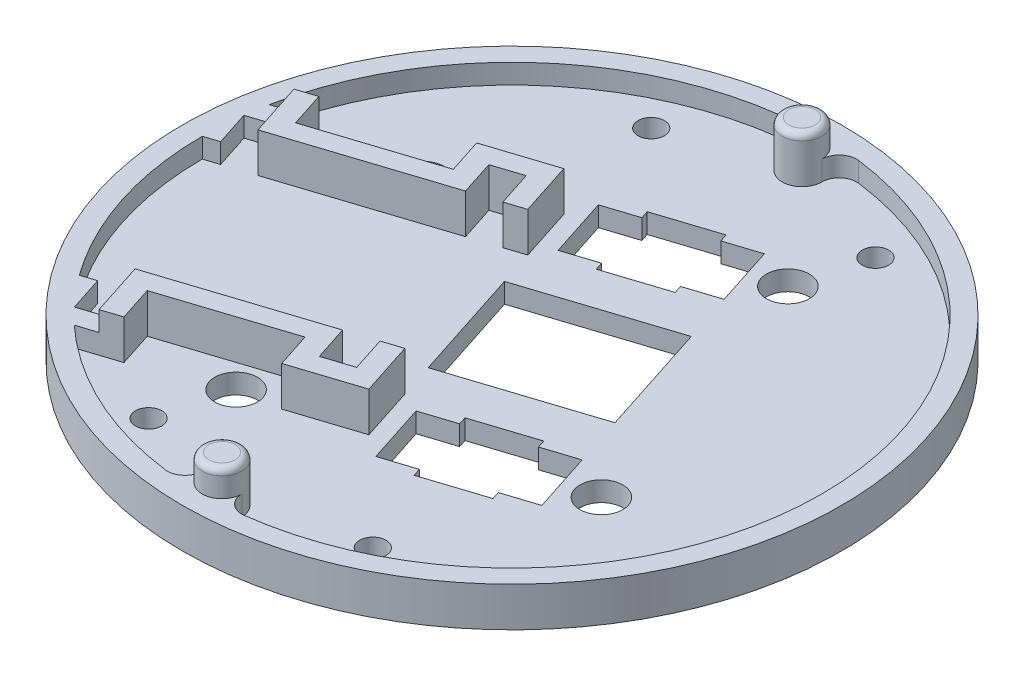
ISO-10303-21;
HEADER;
FILE_DESCRIPTION(('STEP AP214'),'2;1');
FILE_NAME('part.step','',(''),(''),'','','');
FILE_SCHEMA(('AUTOMOTIVE_DESIGN { 1 0 10303 214 1 1 1 1 }'));
ENDSEC;
DATA;
#1=APPLICATION_CONTEXT('core data for automotive mechanical design processes');
#2=APPLICATION_PROTOCOL_DEFINITION('international standard','automotive_design',2000,#1);
#3=PRODUCT_CONTEXT('',#1,'mechanical');
#4=PRODUCT('Part','Part','',(#3));
#5=PRODUCT_RELATED_PRODUCT_CATEGORY('part','',(#4));
#6=PRODUCT_DEFINITION_FORMATION('','',#4);
#7=PRODUCT_DEFINITION_CONTEXT('part definition',#1,'design');
#8=PRODUCT_DEFINITION('design','',#6,#7);
#9=PRODUCT_DEFINITION_SHAPE('','',#8);
#10=(LENGTH_UNIT() NAMED_UNIT(*) SI_UNIT(.MILLI.,.METRE.));
#11=(NAMED_UNIT(*) PLANE_ANGLE_UNIT() SI_UNIT($,.RADIAN.));
#12=(NAMED_UNIT(*) SI_UNIT($,.STERADIAN.) SOLID_ANGLE_UNIT());
#13=UNCERTAINTY_MEASURE_WITH_UNIT(LENGTH_MEASURE(1.E-05),#10,'distance_accuracy_value','');
#14=(GEOMETRIC_REPRESENTATION_CONTEXT(3) GLOBAL_UNCERTAINTY_ASSIGNED_CONTEXT((#13)) GLOBAL_UNIT_ASSIGNED_CONTEXT((#10,
#11,#12)) REPRESENTATION_CONTEXT('',''));
#15=CARTESIAN_POINT('',(0.,0.,0.));
#16=DIRECTION('',(0.,0.,1.));
#17=DIRECTION('',(1.,0.,0.));
#18=AXIS2_PLACEMENT_3D('',#15,#16,#17);
#19=CARTESIAN_POINT('',(0.,4.5,0.));
#20=DIRECTION('',(0.,1.,0.));
#21=DIRECTION('',(0.,0.,1.));
#22=AXIS2_PLACEMENT_3D('',#19,#20,#21);
#23=PLANE('',#22);
#24=DIRECTION('',(-0.308303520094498,0.,-0.951288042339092));
#25=VECTOR('',#24,1.);
#26=CARTESIAN_POINT('',(-36.1489456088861,4.5,11.7155337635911));
#27=LINE('',#26,#25);
#28=CARTESIAN_POINT('',(-42.3150160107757,4.5,-7.31022708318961));
#29=VERTEX_POINT('',#28);
#30=CARTESIAN_POINT('',(-43.2399265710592,4.5,-10.1640912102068));
#31=VERTEX_POINT('',#30);
#32=EDGE_CURVE('E61',#29,#31,#27,.T.);
#33=ORIENTED_EDGE('',*,*,#32,.T.);
#34=DIRECTION('',(-0.951288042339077,0.,0.308303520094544));
#35=VECTOR('',#34,1.);
#36=CARTESIAN_POINT('',(-40.3860624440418,4.5,-11.0890017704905));
#37=LINE('',#36,#35);
#38=CARTESIAN_POINT('',(-46.0821878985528,4.5,-9.24294100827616));
#39=VERTEX_POINT('',#38);
#40=EDGE_CURVE('E1016',#31,#39,#37,.T.);
#41=ORIENTED_EDGE('',*,*,#40,.T.);
#42=CARTESIAN_POINT('',(0.,4.5,0.));
#43=DIRECTION('',(0.,1.,0.));
#44=DIRECTION('',(0.,0.,1.));
#45=AXIS2_PLACEMENT_3D('',#42,#43,#44);
#46=CIRCLE('',#45,47.);
#47=CARTESIAN_POINT('',(-5.97565374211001,4.5,-46.6185752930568));
#48=VERTEX_POINT('',#47);
#49=EDGE_CURVE('E1129',#48,#39,#46,.T.);
#50=ORIENTED_EDGE('',*,*,#49,.F.);
#51=CARTESIAN_POINT('',(-5.64000000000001,4.5,-44.));
#52=DIRECTION('',(0.,1.,0.));
#53=DIRECTION('',(0.,0.,1.));
#54=AXIS2_PLACEMENT_3D('',#51,#52,#53);
#55=CIRCLE('',#54,2.64);
#56=CARTESIAN_POINT('',(-3.00000000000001,4.5,-44.));
#57=VERTEX_POINT('',#56);
#58=EDGE_CURVE('E616',#48,#57,#55,.F.);
#59=ORIENTED_EDGE('',*,*,#58,.T.);
#60=CARTESIAN_POINT('',(0.,4.5,-44.));
#61=DIRECTION('',(0.,1.,0.));
#62=DIRECTION('',(0.,0.,1.));
#63=AXIS2_PLACEMENT_3D('',#60,#61,#62);
#64=CIRCLE('',#63,3.00000000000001);
#65=CARTESIAN_POINT('',(3.00000000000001,4.5,-44.));
#66=VERTEX_POINT('',#65);
#67=EDGE_CURVE('E606',#66,#57,#64,.T.);
#68=ORIENTED_EDGE('',*,*,#67,.F.);
#69=CARTESIAN_POINT('',(5.64000000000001,4.5,-44.));
#70=DIRECTION('',(0.,1.,0.));
#71=DIRECTION('',(0.,0.,1.));
#72=AXIS2_PLACEMENT_3D('',#69,#70,#71);
#73=CIRCLE('',#72,2.64);
#74=CARTESIAN_POINT('',(5.97565374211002,4.5,-46.6185752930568));
#75=VERTEX_POINT('',#74);
#76=EDGE_CURVE('E626',#66,#75,#73,.F.);
#77=ORIENTED_EDGE('',*,*,#76,.T.);
#78=CARTESIAN_POINT('',(5.97565374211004,4.5,46.6185752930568));
#79=VERTEX_POINT('',#78);
#80=EDGE_CURVE('E1287',#79,#75,#46,.T.);
#81=ORIENTED_EDGE('',*,*,#80,.F.);
#82=CARTESIAN_POINT('',(5.64000000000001,4.5,44.));
#83=DIRECTION('',(0.,1.,0.));
#84=DIRECTION('',(0.,0.,1.));
#85=AXIS2_PLACEMENT_3D('',#82,#83,#84);
#86=CIRCLE('',#85,2.64);
#87=CARTESIAN_POINT('',(3.,4.5,44.));
#88=VERTEX_POINT('',#87);
#89=EDGE_CURVE('E655',#79,#88,#86,.F.);
#90=ORIENTED_EDGE('',*,*,#89,.T.);
#91=CARTESIAN_POINT('',(0.,4.5,44.));
#92=DIRECTION('',(0.,1.,0.));
#93=DIRECTION('',(0.,0.,1.));
#94=AXIS2_PLACEMENT_3D('',#91,#92,#93);
#95=CIRCLE('',#94,3.);
#96=CARTESIAN_POINT('',(-3.,4.5,44.));
#97=VERTEX_POINT('',#96);
#98=EDGE_CURVE('E609',#97,#88,#95,.T.);
#99=ORIENTED_EDGE('',*,*,#98,.F.);
#100=CARTESIAN_POINT('',(-5.64000000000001,4.5,44.));
#101=DIRECTION('',(0.,1.,0.));
#102=DIRECTION('',(0.,0.,1.));
#103=AXIS2_PLACEMENT_3D('',#100,#101,#102);
#104=CIRCLE('',#103,2.64);
#105=CARTESIAN_POINT('',(-5.97565374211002,4.5,46.6185752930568));
#106=VERTEX_POINT('',#105);
#107=EDGE_CURVE('E651',#97,#106,#104,.F.);
#108=ORIENTED_EDGE('',*,*,#107,.T.);
#109=CARTESIAN_POINT('',(-31.9002259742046,4.5,34.5163089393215));
#110=VERTEX_POINT('',#109);
#111=EDGE_CURVE('E1134',#110,#106,#46,.T.);
#112=ORIENTED_EDGE('',*,*,#111,.F.);
#113=DIRECTION('',(0.951288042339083,0.,-0.308303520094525));
#114=VECTOR('',#113,1.);
#115=CARTESIAN_POINT('',(-26.2041005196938,4.5,32.6702481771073));
#116=LINE('',#115,#114);
#117=CARTESIAN_POINT('',(-29.057964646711,4.5,33.5951587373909));
#118=VERTEX_POINT('',#117);
#119=EDGE_CURVE('E68',#110,#118,#116,.T.);
#120=ORIENTED_EDGE('',*,*,#119,.T.);
#121=DIRECTION('',(0.308303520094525,0.,0.951288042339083));
#122=VECTOR('',#121,1.);
#123=CARTESIAN_POINT('',(-36.1489456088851,4.5,11.7155337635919));
#124=LINE('',#123,#122);
#125=CARTESIAN_POINT('',(-29.9828752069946,4.5,30.7412946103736));
#126=VERTEX_POINT('',#125);
#127=EDGE_CURVE('E565',#126,#118,#124,.T.);
#128=ORIENTED_EDGE('',*,*,#127,.F.);
#129=DIRECTION('',(-0.951288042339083,0.,0.308303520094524));
#130=VECTOR('',#129,1.);
#131=CARTESIAN_POINT('',(-34.2636713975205,4.5,32.128660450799));
#132=LINE('',#131,#130);
#133=CARTESIAN_POINT('',(-34.2636713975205,4.5,32.128660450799));
#134=VERTEX_POINT('',#133);
#135=EDGE_CURVE('E977',#126,#134,#132,.T.);
#136=ORIENTED_EDGE('',*,*,#135,.T.);
#137=DIRECTION('',(-0.308303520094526,0.,-0.951288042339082));
#138=VECTOR('',#137,1.);
#139=CARTESIAN_POINT('',(-35.9593407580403,4.5,26.8965762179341));
#140=LINE('',#139,#138);
#141=CARTESIAN_POINT('',(-35.9593407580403,4.5,26.8965762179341));
#142=VERTEX_POINT('',#141);
#143=EDGE_CURVE('E974',#134,#142,#140,.T.);
#144=ORIENTED_EDGE('',*,*,#143,.T.);
#145=DIRECTION('',(-0.951288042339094,0.,0.30830352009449));
#146=VECTOR('',#145,1.);
#147=CARTESIAN_POINT('',(-38.0591968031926,4.5,27.5771198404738));
#148=LINE('',#147,#146);
#149=CARTESIAN_POINT('',(-38.0591968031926,4.5,27.5771198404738));
#150=VERTEX_POINT('',#149);
#151=EDGE_CURVE('E916',#142,#150,#148,.T.);
#152=ORIENTED_EDGE('',*,*,#151,.T.);
#153=CARTESIAN_POINT('',(-46.9999988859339,4.5,-0.0102333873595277));
#154=VERTEX_POINT('',#153);
#155=EDGE_CURVE('E1130',#154,#150,#46,.T.);
#156=ORIENTED_EDGE('',*,*,#155,.F.);
#157=DIRECTION('',(0.951288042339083,0.,-0.308303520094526));
#158=VECTOR('',#157,1.);
#159=CARTESIAN_POINT('',(-46.9999988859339,4.5,-0.0102333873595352));
#160=LINE('',#159,#158);
#161=CARTESIAN_POINT('',(-44.9001428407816,4.5,-0.690777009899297));
#162=VERTEX_POINT('',#161);
#163=EDGE_CURVE('E1086',#154,#162,#160,.T.);
#164=ORIENTED_EDGE('',*,*,#163,.T.);
#165=DIRECTION('',(-0.308303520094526,0.,-0.951288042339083));
#166=VECTOR('',#165,1.);
#167=CARTESIAN_POINT('',(-44.9001428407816,4.5,-0.690777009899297));
#168=LINE('',#167,#166);
#169=CARTESIAN_POINT('',(-46.5958122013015,4.5,-5.92286124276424));
#170=VERTEX_POINT('',#169);
#171=EDGE_CURVE('E1082',#162,#170,#168,.T.);
#172=ORIENTED_EDGE('',*,*,#171,.T.);
#173=DIRECTION('',(0.951288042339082,0.,-0.308303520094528));
#174=VECTOR('',#173,1.);
#175=CARTESIAN_POINT('',(-46.5958122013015,4.5,-5.92286124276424));
#176=LINE('',#175,#174);
#177=EDGE_CURVE('E1078',#170,#29,#176,.T.);
#178=ORIENTED_EDGE('',*,*,#177,.T.);
#179=EDGE_LOOP('',(#33,#41,#50,#59,#68,#77,#81,#90,#99,#108,#112,#120,#128,#136,#144,#152,#156,
#164,#172,#178));
#180=FACE_BOUND('',#179,.T.);
#181=CARTESIAN_POINT('',(0.,4.5,0.));
#182=DIRECTION('',(0.,1.,0.));
#183=DIRECTION('',(0.,0.,1.));
#184=AXIS2_PLACEMENT_3D('',#181,#182,#183);
#185=CIRCLE('',#184,50.);
#186=CARTESIAN_POINT('',(0.,4.5,50.));
#187=VERTEX_POINT('',#186);
#188=EDGE_CURVE('E1133',#187,#187,#185,.T.);
#189=ORIENTED_EDGE('',*,*,#188,.T.);
#190=EDGE_LOOP('',(#189));
#191=FACE_BOUND('',#190,.T.);
#192=ADVANCED_FACE('F43',(#180,#191),#23,.T.);
#193=CARTESIAN_POINT('',(0.,1.5,0.));
#194=DIRECTION('',(0.,1.,0.));
#195=DIRECTION('',(0.,0.,1.));
#196=AXIS2_PLACEMENT_3D('',#193,#194,#195);
#197=PLANE('',#196);
#198=CARTESIAN_POINT('',(27.7110143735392,1.5,14.1456594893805));
#199=DIRECTION('',(0.,1.,0.));
#200=DIRECTION('',(0.,0.,1.));
#201=AXIS2_PLACEMENT_3D('',#198,#199,#200);
#202=CIRCLE('',#201,3.25);
#203=CARTESIAN_POINT('',(27.7110143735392,1.5,17.3956594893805));
#204=VERTEX_POINT('',#203);
#205=EDGE_CURVE('E654',#204,#204,#202,.T.);
#206=ORIENTED_EDGE('',*,*,#205,.F.);
#207=EDGE_LOOP('',(#206));
#208=FACE_BOUND('',#207,.T.);
#209=CARTESIAN_POINT('',(14.1456594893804,1.5,-27.7110143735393));
#210=DIRECTION('',(0.,1.,0.));
#211=DIRECTION('',(0.,0.,1.));
#212=AXIS2_PLACEMENT_3D('',#209,#210,#211);
#213=CIRCLE('',#212,3.25);
#214=CARTESIAN_POINT('',(14.1456594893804,1.5,-24.4610143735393));
#215=VERTEX_POINT('',#214);
#216=EDGE_CURVE('E668',#215,#215,#213,.T.);
#217=ORIENTED_EDGE('',*,*,#216,.F.);
#218=EDGE_LOOP('',(#217));
#219=FACE_BOUND('',#218,.T.);
#220=CARTESIAN_POINT('',(-27.7110143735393,1.5,-14.1456594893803));
#221=DIRECTION('',(0.,1.,0.));
#222=DIRECTION('',(0.,0.,1.));
#223=AXIS2_PLACEMENT_3D('',#220,#221,#222);
#224=CIRCLE('',#223,3.25);
#225=CARTESIAN_POINT('',(-27.7110143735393,1.5,-10.8956594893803));
#226=VERTEX_POINT('',#225);
#227=EDGE_CURVE('E674',#226,#226,#224,.T.);
#228=ORIENTED_EDGE('',*,*,#227,.F.);
#229=EDGE_LOOP('',(#228));
#230=FACE_BOUND('',#229,.T.);
#231=CARTESIAN_POINT('',(-14.1456594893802,1.5,27.7110143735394));
#232=DIRECTION('',(0.,1.,0.));
#233=DIRECTION('',(0.,0.,1.));
#234=AXIS2_PLACEMENT_3D('',#231,#232,#233);
#235=CIRCLE('',#234,3.25);
#236=CARTESIAN_POINT('',(-14.1456594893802,1.5,30.9610143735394));
#237=VERTEX_POINT('',#236);
#238=EDGE_CURVE('E680',#237,#237,#235,.T.);
#239=ORIENTED_EDGE('',*,*,#238,.F.);
#240=EDGE_LOOP('',(#239));
#241=FACE_BOUND('',#240,.T.);
#242=DIRECTION('',(0.951288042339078,0.,-0.308303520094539));
#243=VECTOR('',#242,1.);
#244=CARTESIAN_POINT('',(19.2706018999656,1.5,21.3487447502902));
#245=LINE('',#244,#243);
#246=CARTESIAN_POINT('',(19.2706018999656,1.5,21.3487447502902));
#247=VERTEX_POINT('',#246);
#248=CARTESIAN_POINT('',(24.2648641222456,1.5,19.7301512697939));
#249=VERTEX_POINT('',#248);
#250=EDGE_CURVE('E686',#247,#249,#245,.T.);
#251=ORIENTED_EDGE('',*,*,#250,.F.);
#252=DIRECTION('',(-0.308303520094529,0.,-0.951288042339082));
#253=VECTOR('',#252,1.);
#254=CARTESIAN_POINT('',(19.2706018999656,1.5,21.3487447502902));
#255=LINE('',#254,#253);
#256=CARTESIAN_POINT('',(19.6559813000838,1.5,22.537854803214));
#257=VERTEX_POINT('',#256);
#258=EDGE_CURVE('E693',#257,#247,#255,.T.);
#259=ORIENTED_EDGE('',*,*,#258,.F.);
#260=DIRECTION('',(0.951288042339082,0.,-0.308303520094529));
#261=VECTOR('',#260,1.);
#262=CARTESIAN_POINT('',(10.6187448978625,1.5,25.4667382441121));
#263=LINE('',#262,#261);
#264=CARTESIAN_POINT('',(10.6187448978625,1.5,25.4667382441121));
#265=VERTEX_POINT('',#264);
#266=EDGE_CURVE('E755',#265,#257,#263,.T.);
#267=ORIENTED_EDGE('',*,*,#266,.F.);
#268=DIRECTION('',(0.30830352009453,0.,0.951288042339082));
#269=VECTOR('',#268,1.);
#270=CARTESIAN_POINT('',(10.2333654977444,1.5,24.2776281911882));
#271=LINE('',#270,#269);
#272=CARTESIAN_POINT('',(10.2333654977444,1.5,24.2776281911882));
#273=VERTEX_POINT('',#272);
#274=EDGE_CURVE('E752',#273,#265,#271,.T.);
#275=ORIENTED_EDGE('',*,*,#274,.F.);
#276=DIRECTION('',(0.951288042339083,0.,-0.308303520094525));
#277=VECTOR('',#276,1.);
#278=CARTESIAN_POINT('',(5.23910327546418,1.5,25.8962216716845));
#279=LINE('',#278,#277);
#280=CARTESIAN_POINT('',(5.23910327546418,1.5,25.8962216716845));
#281=VERTEX_POINT('',#280);
#282=EDGE_CURVE('E749',#281,#273,#279,.T.);
#283=ORIENTED_EDGE('',*,*,#282,.F.);
#284=DIRECTION('',(0.308303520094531,0.,0.951288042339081));
#285=VECTOR('',#284,1.);
#286=CARTESIAN_POINT('',(5.23910327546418,1.5,25.8962216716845));
#287=LINE('',#286,#285);
#288=CARTESIAN_POINT('',(2.31021983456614,1.5,16.8589852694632));
#289=VERTEX_POINT('',#288);
#290=EDGE_CURVE('E746',#289,#281,#287,.T.);
#291=ORIENTED_EDGE('',*,*,#290,.F.);
#292=DIRECTION('',(-0.95128804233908,0.,0.308303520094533));
#293=VECTOR('',#292,1.);
#294=CARTESIAN_POINT('',(2.31021983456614,1.5,16.8589852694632));
#295=LINE('',#294,#293);
#296=CARTESIAN_POINT('',(7.3044820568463,1.5,15.2403917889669));
#297=VERTEX_POINT('',#296);
#298=EDGE_CURVE('E743',#297,#289,#295,.T.);
#299=ORIENTED_EDGE('',*,*,#298,.F.);
#300=DIRECTION('',(0.308303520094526,0.,0.951288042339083));
#301=VECTOR('',#300,1.);
#302=CARTESIAN_POINT('',(7.3044820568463,1.5,15.2403917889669));
#303=LINE('',#302,#301);
#304=CARTESIAN_POINT('',(6.91910265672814,1.5,14.051281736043));
#305=VERTEX_POINT('',#304);
#306=EDGE_CURVE('E740',#305,#297,#303,.T.);
#307=ORIENTED_EDGE('',*,*,#306,.F.);
#308=DIRECTION('',(-0.951288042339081,0.,0.30830352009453));
#309=VECTOR('',#308,1.);
#310=CARTESIAN_POINT('',(6.91910265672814,1.5,14.051281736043));
#311=LINE('',#310,#309);
#312=CARTESIAN_POINT('',(15.9563390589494,1.5,11.122398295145));
#313=VERTEX_POINT('',#312);
#314=EDGE_CURVE('E737',#313,#305,#311,.T.);
#315=ORIENTED_EDGE('',*,*,#314,.F.);
#316=DIRECTION('',(-0.308303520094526,0.,-0.951288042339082));
#317=VECTOR('',#316,1.);
#318=CARTESIAN_POINT('',(15.9563390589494,1.5,11.122398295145));
#319=LINE('',#318,#317);
#320=CARTESIAN_POINT('',(16.3417184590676,1.5,12.3115083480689));
#321=VERTEX_POINT('',#320);
#322=EDGE_CURVE('E734',#321,#313,#319,.T.);
#323=ORIENTED_EDGE('',*,*,#322,.F.);
#324=DIRECTION('',(-0.951288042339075,0.,0.30830352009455));
#325=VECTOR('',#324,1.);
#326=CARTESIAN_POINT('',(16.3417184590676,1.5,12.3115083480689));
#327=LINE('',#326,#325);
#328=CARTESIAN_POINT('',(21.3359806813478,1.5,10.6929148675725));
#329=VERTEX_POINT('',#328);
#330=EDGE_CURVE('E731',#329,#321,#327,.T.);
#331=ORIENTED_EDGE('',*,*,#330,.F.);
#332=DIRECTION('',(-0.308303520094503,0.,-0.95128804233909));
#333=VECTOR('',#332,1.);
#334=CARTESIAN_POINT('',(21.3359806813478,1.5,10.6929148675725));
#335=LINE('',#334,#333);
#336=EDGE_CURVE('E728',#249,#329,#335,.T.);
#337=ORIENTED_EDGE('',*,*,#336,.F.);
#338=EDGE_LOOP('',(#251,#259,#267,#275,#283,#291,#299,#307,#315,#323,#331,#337));
#339=FACE_BOUND('',#338,.T.);
#340=DIRECTION('',(0.951288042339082,0.,-0.308303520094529));
#341=VECTOR('',#340,1.);
#342=CARTESIAN_POINT('',(18.9466284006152,1.5,3.32043253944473));
#343=LINE('',#342,#341);
#344=CARTESIAN_POINT('',(-2.45735255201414,1.5,10.2572617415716));
#345=VERTEX_POINT('',#344);
#346=CARTESIAN_POINT('',(18.9466284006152,1.5,3.32043253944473));
#347=VERTEX_POINT('',#346);
#348=EDGE_CURVE('E762',#345,#347,#343,.T.);
#349=ORIENTED_EDGE('',*,*,#348,.F.);
#350=DIRECTION('',(0.30830352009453,0.,0.951288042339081));
#351=VECTOR('',#350,1.);
#352=CARTESIAN_POINT('',(-2.45735255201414,1.5,10.2572617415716));
#353=LINE('',#352,#351);
#354=CARTESIAN_POINT('',(-8.00681591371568,1.5,-6.86592302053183));
#355=VERTEX_POINT('',#354);
#356=EDGE_CURVE('E789',#355,#345,#353,.T.);
#357=ORIENTED_EDGE('',*,*,#356,.F.);
#358=DIRECTION('',(-0.951288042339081,0.,0.30830352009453));
#359=VECTOR('',#358,1.);
#360=CARTESIAN_POINT('',(-8.00681591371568,1.5,-6.86592302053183));
#361=LINE('',#360,#359);
#362=CARTESIAN_POINT('',(13.3971650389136,1.5,-13.8027522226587));
#363=VERTEX_POINT('',#362);
#364=EDGE_CURVE('E803',#363,#355,#361,.T.);
#365=ORIENTED_EDGE('',*,*,#364,.F.);
#366=DIRECTION('',(-0.30830352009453,0.,-0.951288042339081));
#367=VECTOR('',#366,1.);
#368=CARTESIAN_POINT('',(13.3971650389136,1.5,-13.8027522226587));
#369=LINE('',#368,#367);
#370=EDGE_CURVE('E800',#347,#363,#369,.T.);
#371=ORIENTED_EDGE('',*,*,#370,.F.);
#372=EDGE_LOOP('',(#349,#357,#365,#371));
#373=FACE_BOUND('',#372,.T.);
#374=DIRECTION('',(0.308303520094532,0.,0.951288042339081));
#375=VECTOR('',#374,1.);
#376=CARTESIAN_POINT('',(-10.9468315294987,1.5,-24.0464005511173));
#377=LINE('',#376,#375);
#378=CARTESIAN_POINT('',(-10.9468315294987,1.5,-24.0464005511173));
#379=VERTEX_POINT('',#378);
#380=CARTESIAN_POINT('',(-8.01794808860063,1.5,-15.009164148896));
#381=VERTEX_POINT('',#380);
#382=EDGE_CURVE('E810',#379,#381,#377,.T.);
#383=ORIENTED_EDGE('',*,*,#382,.F.);
#384=DIRECTION('',(-0.951288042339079,0.,0.308303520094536));
#385=VECTOR('',#384,1.);
#386=CARTESIAN_POINT('',(-10.9468315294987,1.5,-24.0464005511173));
#387=LINE('',#386,#385);
#388=CARTESIAN_POINT('',(-5.95256930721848,1.5,-25.6649940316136));
#389=VERTEX_POINT('',#388);
#390=EDGE_CURVE('E821',#389,#379,#387,.T.);
#391=ORIENTED_EDGE('',*,*,#390,.F.);
#392=DIRECTION('',(0.308303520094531,0.,0.951288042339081));
#393=VECTOR('',#392,1.);
#394=CARTESIAN_POINT('',(-5.95256930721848,1.5,-25.6649940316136));
#395=LINE('',#394,#393);
#396=CARTESIAN_POINT('',(-6.33794870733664,1.5,-26.8541040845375));
#397=VERTEX_POINT('',#396);
#398=EDGE_CURVE('E883',#397,#389,#395,.T.);
#399=ORIENTED_EDGE('',*,*,#398,.F.);
#400=DIRECTION('',(-0.951288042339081,0.,0.30830352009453));
#401=VECTOR('',#400,1.);
#402=CARTESIAN_POINT('',(-6.33794870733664,1.5,-26.8541040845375));
#403=LINE('',#402,#401);
#404=CARTESIAN_POINT('',(2.69928769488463,1.5,-29.7829875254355));
#405=VERTEX_POINT('',#404);
#406=EDGE_CURVE('E880',#405,#397,#403,.T.);
#407=ORIENTED_EDGE('',*,*,#406,.F.);
#408=DIRECTION('',(-0.308303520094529,0.,-0.951288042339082));
#409=VECTOR('',#408,1.);
#410=CARTESIAN_POINT('',(3.0846670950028,1.5,-28.5938774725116));
#411=LINE('',#410,#409);
#412=CARTESIAN_POINT('',(3.0846670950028,1.5,-28.5938774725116));
#413=VERTEX_POINT('',#412);
#414=EDGE_CURVE('E877',#413,#405,#411,.T.);
#415=ORIENTED_EDGE('',*,*,#414,.F.);
#416=DIRECTION('',(-0.951288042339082,0.,0.308303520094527));
#417=VECTOR('',#416,1.);
#418=CARTESIAN_POINT('',(3.0846670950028,1.5,-28.5938774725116));
#419=LINE('',#418,#417);
#420=CARTESIAN_POINT('',(8.07892931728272,1.5,-30.2124709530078));
#421=VERTEX_POINT('',#420);
#422=EDGE_CURVE('E874',#421,#413,#419,.T.);
#423=ORIENTED_EDGE('',*,*,#422,.F.);
#424=DIRECTION('',(-0.308303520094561,0.,-0.951288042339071));
#425=VECTOR('',#424,1.);
#426=CARTESIAN_POINT('',(11.0078127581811,1.5,-21.1752345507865));
#427=LINE('',#426,#425);
#428=CARTESIAN_POINT('',(11.0078127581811,1.5,-21.1752345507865));
#429=VERTEX_POINT('',#428);
#430=EDGE_CURVE('E871',#429,#421,#427,.T.);
#431=ORIENTED_EDGE('',*,*,#430,.F.);
#432=DIRECTION('',(0.951288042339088,0.,-0.308303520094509));
#433=VECTOR('',#432,1.);
#434=CARTESIAN_POINT('',(6.01355053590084,1.5,-19.5566410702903));
#435=LINE('',#434,#433);
#436=CARTESIAN_POINT('',(6.01355053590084,1.5,-19.5566410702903));
#437=VERTEX_POINT('',#436);
#438=EDGE_CURVE('E868',#437,#429,#435,.T.);
#439=ORIENTED_EDGE('',*,*,#438,.F.);
#440=DIRECTION('',(-0.308303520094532,0.,-0.95128804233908));
#441=VECTOR('',#440,1.);
#442=CARTESIAN_POINT('',(6.39892993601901,1.5,-18.3675310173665));
#443=LINE('',#442,#441);
#444=CARTESIAN_POINT('',(6.39892993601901,1.5,-18.3675310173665));
#445=VERTEX_POINT('',#444);
#446=EDGE_CURVE('E865',#445,#437,#443,.T.);
#447=ORIENTED_EDGE('',*,*,#446,.F.);
#448=DIRECTION('',(0.951288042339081,0.,-0.30830352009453));
#449=VECTOR('',#448,1.);
#450=CARTESIAN_POINT('',(-2.63830646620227,1.5,-15.4386475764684));
#451=LINE('',#450,#449);
#452=CARTESIAN_POINT('',(-2.63830646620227,1.5,-15.4386475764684));
#453=VERTEX_POINT('',#452);
#454=EDGE_CURVE('E862',#453,#445,#451,.T.);
#455=ORIENTED_EDGE('',*,*,#454,.F.);
#456=DIRECTION('',(0.308303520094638,0.,0.951288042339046));
#457=VECTOR('',#456,1.);
#458=CARTESIAN_POINT('',(-3.02368586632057,1.5,-16.6277576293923));
#459=LINE('',#458,#457);
#460=CARTESIAN_POINT('',(-3.02368586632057,1.5,-16.6277576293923));
#461=VERTEX_POINT('',#460);
#462=EDGE_CURVE('E859',#461,#453,#459,.T.);
#463=ORIENTED_EDGE('',*,*,#462,.F.);
#464=DIRECTION('',(0.951288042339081,0.,-0.308303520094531));
#465=VECTOR('',#464,1.);
#466=CARTESIAN_POINT('',(-8.01794808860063,1.5,-15.009164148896));
#467=LINE('',#466,#465);
#468=EDGE_CURVE('E856',#381,#461,#467,.T.);
#469=ORIENTED_EDGE('',*,*,#468,.F.);
#470=EDGE_LOOP('',(#383,#391,#399,#407,#415,#423,#431,#439,#447,#455,#463,#469));
#471=FACE_BOUND('',#470,.T.);
#472=CARTESIAN_POINT('',(-17.0092592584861,1.5,38.1280421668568));
#473=DIRECTION('',(0.,1.,0.));
#474=DIRECTION('',(0.,0.,-1.));
#475=AXIS2_PLACEMENT_3D('',#472,#473,#474);
#476=CIRCLE('',#475,2.);
#477=CARTESIAN_POINT('',(-17.0092592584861,1.5,36.1280421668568));
#478=VERTEX_POINT('',#477);
#479=EDGE_CURVE('E1143',#478,#478,#476,.T.);
#480=ORIENTED_EDGE('',*,*,#479,.F.);
#481=EDGE_LOOP('',(#480));
#482=FACE_BOUND('',#481,.T.);
#483=CARTESIAN_POINT('',(-17.009259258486,1.5,-38.1280421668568));
#484=DIRECTION('',(0.,1.,0.));
#485=DIRECTION('',(0.,0.,1.));
#486=AXIS2_PLACEMENT_3D('',#483,#484,#485);
#487=CIRCLE('',#486,2.);
#488=CARTESIAN_POINT('',(-17.009259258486,1.5,-36.1280421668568));
#489=VERTEX_POINT('',#488);
#490=EDGE_CURVE('E1148',#489,#489,#487,.T.);
#491=ORIENTED_EDGE('',*,*,#490,.F.);
#492=EDGE_LOOP('',(#491));
#493=FACE_BOUND('',#492,.T.);
#494=CARTESIAN_POINT('',(17.009259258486,1.5,-38.1280421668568));
#495=DIRECTION('',(0.,1.,0.));
#496=DIRECTION('',(0.,0.,-1.));
#497=AXIS2_PLACEMENT_3D('',#494,#495,#496);
#498=CIRCLE('',#497,2.);
#499=CARTESIAN_POINT('',(17.009259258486,1.5,-40.1280421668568));
#500=VERTEX_POINT('',#499);
#501=EDGE_CURVE('E1155',#500,#500,#498,.T.);
#502=ORIENTED_EDGE('',*,*,#501,.F.);
#503=EDGE_LOOP('',(#502));
#504=FACE_BOUND('',#503,.T.);
#505=CARTESIAN_POINT('',(17.0092592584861,1.5,38.1280421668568));
#506=DIRECTION('',(0.,1.,0.));
#507=DIRECTION('',(0.,0.,1.));
#508=AXIS2_PLACEMENT_3D('',#505,#506,#507);
#509=CIRCLE('',#508,2.);
#510=CARTESIAN_POINT('',(17.0092592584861,1.5,40.1280421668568));
#511=VERTEX_POINT('',#510);
#512=EDGE_CURVE('E1162',#511,#511,#509,.T.);
#513=ORIENTED_EDGE('',*,*,#512,.F.);
#514=EDGE_LOOP('',(#513));
#515=FACE_BOUND('',#514,.T.);
#516=CARTESIAN_POINT('',(0.,1.5,0.));
#517=DIRECTION('',(0.,1.,0.));
#518=DIRECTION('',(0.,0.,1.));
#519=AXIS2_PLACEMENT_3D('',#516,#517,#518);
#520=CIRCLE('',#519,47.);
#521=CARTESIAN_POINT('',(5.97565374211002,1.5,-46.6185752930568));
#522=VERTEX_POINT('',#521);
#523=CARTESIAN_POINT('',(5.97565374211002,1.5,46.6185752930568));
#524=VERTEX_POINT('',#523);
#525=EDGE_CURVE('E1144',#522,#524,#520,.F.);
#526=ORIENTED_EDGE('',*,*,#525,.F.);
#527=CARTESIAN_POINT('',(5.64000000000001,1.5,-44.));
#528=DIRECTION('',(0.,-1.,0.));
#529=DIRECTION('',(0.,0.,-1.));
#530=AXIS2_PLACEMENT_3D('',#527,#528,#529);
#531=CIRCLE('',#530,2.64);
#532=CARTESIAN_POINT('',(3.,1.5,-44.));
#533=VERTEX_POINT('',#532);
#534=EDGE_CURVE('E618',#533,#522,#531,.T.);
#535=ORIENTED_EDGE('',*,*,#534,.F.);
#536=CARTESIAN_POINT('',(0.,1.5,-44.));
#537=DIRECTION('',(0.,1.,0.));
#538=DIRECTION('',(0.,0.,-1.));
#539=AXIS2_PLACEMENT_3D('',#536,#537,#538);
#540=CIRCLE('',#539,3.);
#541=CARTESIAN_POINT('',(-3.00000000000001,1.5,-44.));
#542=VERTEX_POINT('',#541);
#543=EDGE_CURVE('E623',#542,#533,#540,.T.);
#544=ORIENTED_EDGE('',*,*,#543,.F.);
#545=CARTESIAN_POINT('',(-5.64000000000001,1.5,-44.));
#546=DIRECTION('',(0.,-1.,0.));
#547=DIRECTION('',(0.,0.,1.));
#548=AXIS2_PLACEMENT_3D('',#545,#546,#547);
#549=CIRCLE('',#548,2.64);
#550=CARTESIAN_POINT('',(-5.97565374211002,1.5,-46.6185752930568));
#551=VERTEX_POINT('',#550);
#552=EDGE_CURVE('E613',#551,#542,#549,.T.);
#553=ORIENTED_EDGE('',*,*,#552,.F.);
#554=CARTESIAN_POINT('',(-46.0821878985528,1.5,-9.24294100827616));
#555=VERTEX_POINT('',#554);
#556=EDGE_CURVE('E1139',#555,#551,#520,.F.);
#557=ORIENTED_EDGE('',*,*,#556,.F.);
#558=DIRECTION('',(-0.951288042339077,0.,0.308303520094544));
#559=VECTOR('',#558,1.);
#560=CARTESIAN_POINT('',(-40.3860624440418,1.5,-11.0890017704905));
#561=LINE('',#560,#559);
#562=CARTESIAN_POINT('',(-40.3860624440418,1.5,-11.0890017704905));
#563=VERTEX_POINT('',#562);
#564=EDGE_CURVE('E1035',#563,#555,#561,.T.);
#565=ORIENTED_EDGE('',*,*,#564,.F.);
#566=DIRECTION('',(-0.308303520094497,0.,-0.951288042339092));
#567=VECTOR('',#566,1.);
#568=CARTESIAN_POINT('',(-38.6903930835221,1.5,-5.85691753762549));
#569=LINE('',#568,#567);
#570=CARTESIAN_POINT('',(-38.6903930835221,1.5,-5.85691753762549));
#571=VERTEX_POINT('',#570);
#572=EDGE_CURVE('E1041',#571,#563,#569,.T.);
#573=ORIENTED_EDGE('',*,*,#572,.F.);
#574=DIRECTION('',(-0.951288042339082,0.,0.308303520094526));
#575=VECTOR('',#574,1.);
#576=CARTESIAN_POINT('',(-20.6159202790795,1.5,-11.7146844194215));
#577=LINE('',#576,#575);
#578=CARTESIAN_POINT('',(-20.6159202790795,1.5,-11.7146844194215));
#579=VERTEX_POINT('',#578);
#580=EDGE_CURVE('E1046',#579,#571,#577,.T.);
#581=ORIENTED_EDGE('',*,*,#580,.F.);
#582=DIRECTION('',(0.308303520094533,0.,0.95128804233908));
#583=VECTOR('',#582,1.);
#584=CARTESIAN_POINT('',(-22.3115896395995,1.5,-16.9467686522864));
#585=LINE('',#584,#583);
#586=CARTESIAN_POINT('',(-22.3115896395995,1.5,-16.9467686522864));
#587=VERTEX_POINT('',#586);
#588=EDGE_CURVE('E1051',#587,#579,#585,.T.);
#589=ORIENTED_EDGE('',*,*,#588,.F.);
#590=DIRECTION('',(-0.951288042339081,0.,0.308303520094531));
#591=VECTOR('',#590,1.);
#592=CARTESIAN_POINT('',(-12.3230651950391,1.5,-20.183955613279));
#593=LINE('',#592,#591);
#594=CARTESIAN_POINT('',(-12.3230651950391,1.5,-20.183955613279));
#595=VERTEX_POINT('',#594);
#596=EDGE_CURVE('E1055',#595,#587,#593,.T.);
#597=ORIENTED_EDGE('',*,*,#596,.F.);
#598=DIRECTION('',(-0.30830352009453,0.,-0.951288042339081));
#599=VECTOR('',#598,1.);
#600=CARTESIAN_POINT('',(-9.70248527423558,1.5,-12.0980072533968));
#601=LINE('',#600,#599);
#602=CARTESIAN_POINT('',(-9.70248527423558,1.5,-12.0980072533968));
#603=VERTEX_POINT('',#602);
#604=EDGE_CURVE('E1059',#603,#595,#601,.T.);
#605=ORIENTED_EDGE('',*,*,#604,.F.);
#606=DIRECTION('',(0.951288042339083,0.,-0.308303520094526));
#607=VECTOR('',#606,1.);
#608=CARTESIAN_POINT('',(-12.5563494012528,1.5,-11.1730966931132));
#609=LINE('',#608,#607);
#610=CARTESIAN_POINT('',(-12.5563494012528,1.5,-11.1730966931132));
#611=VERTEX_POINT('',#610);
#612=EDGE_CURVE('E1063',#611,#603,#609,.T.);
#613=ORIENTED_EDGE('',*,*,#612,.F.);
#614=DIRECTION('',(0.308303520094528,0.,0.951288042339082));
#615=VECTOR('',#614,1.);
#616=CARTESIAN_POINT('',(-14.2520187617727,1.5,-16.4051809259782));
#617=LINE('',#616,#615);
#618=CARTESIAN_POINT('',(-14.2520187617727,1.5,-16.4051809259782));
#619=VERTEX_POINT('',#618);
#620=EDGE_CURVE('E1067',#619,#611,#617,.T.);
#621=ORIENTED_EDGE('',*,*,#620,.F.);
#622=DIRECTION('',(0.951288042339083,0.,-0.308303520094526));
#623=VECTOR('',#622,1.);
#624=CARTESIAN_POINT('',(-18.5328149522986,1.5,-15.0178150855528));
#625=LINE('',#624,#623);
#626=CARTESIAN_POINT('',(-18.5328149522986,1.5,-15.0178150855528));
#627=VERTEX_POINT('',#626);
#628=EDGE_CURVE('E1071',#627,#619,#625,.T.);
#629=ORIENTED_EDGE('',*,*,#628,.F.);
#630=DIRECTION('',(-0.308303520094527,0.,-0.951288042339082));
#631=VECTOR('',#630,1.);
#632=CARTESIAN_POINT('',(-16.8371455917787,1.5,-9.78573085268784));
#633=LINE('',#632,#631);
#634=CARTESIAN_POINT('',(-16.8371455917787,1.5,-9.78573085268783));
#635=VERTEX_POINT('',#634);
#636=EDGE_CURVE('E1075',#635,#627,#633,.T.);
#637=ORIENTED_EDGE('',*,*,#636,.F.);
#638=DIRECTION('',(0.951288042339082,0.,-0.308303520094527));
#639=VECTOR('',#638,1.);
#640=CARTESIAN_POINT('',(-40.6193466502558,1.5,-2.07814285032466));
#641=LINE('',#640,#639);
#642=CARTESIAN_POINT('',(-40.6193466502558,1.5,-2.07814285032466));
#643=VERTEX_POINT('',#642);
#644=EDGE_CURVE('E511',#643,#635,#641,.T.);
#645=ORIENTED_EDGE('',*,*,#644,.F.);
#646=DIRECTION('',(0.308303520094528,0.,0.951288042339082));
#647=VECTOR('',#646,1.);
#648=CARTESIAN_POINT('',(-42.3150160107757,1.5,-7.31022708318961));
#649=LINE('',#648,#647);
#650=CARTESIAN_POINT('',(-42.3150160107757,1.5,-7.31022708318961));
#651=VERTEX_POINT('',#650);
#652=EDGE_CURVE('E507',#651,#643,#649,.T.);
#653=ORIENTED_EDGE('',*,*,#652,.F.);
#654=DIRECTION('',(0.951288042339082,0.,-0.308303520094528));
#655=VECTOR('',#654,1.);
#656=CARTESIAN_POINT('',(-46.5958122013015,1.5,-5.92286124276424));
#657=LINE('',#656,#655);
#658=CARTESIAN_POINT('',(-46.5958122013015,1.5,-5.92286124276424));
#659=VERTEX_POINT('',#658);
#660=EDGE_CURVE('E1020',#659,#651,#657,.T.);
#661=ORIENTED_EDGE('',*,*,#660,.F.);
#662=DIRECTION('',(-0.308303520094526,0.,-0.951288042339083));
#663=VECTOR('',#662,1.);
#664=CARTESIAN_POINT('',(-44.9001428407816,1.5,-0.690777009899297));
#665=LINE('',#664,#663);
#666=CARTESIAN_POINT('',(-44.9001428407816,1.5,-0.690777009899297));
#667=VERTEX_POINT('',#666);
#668=EDGE_CURVE('E1025',#667,#659,#665,.T.);
#669=ORIENTED_EDGE('',*,*,#668,.F.);
#670=DIRECTION('',(0.951288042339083,0.,-0.308303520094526));
#671=VECTOR('',#670,1.);
#672=CARTESIAN_POINT('',(-46.9999988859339,1.5,-0.0102333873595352));
#673=LINE('',#672,#671);
#674=CARTESIAN_POINT('',(-46.9999988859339,1.5,-0.0102333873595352));
#675=VERTEX_POINT('',#674);
#676=EDGE_CURVE('E1030',#675,#667,#673,.T.);
#677=ORIENTED_EDGE('',*,*,#676,.F.);
#678=CARTESIAN_POINT('',(-38.0591968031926,1.5,27.5771198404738));
#679=VERTEX_POINT('',#678);
#680=EDGE_CURVE('E1138',#679,#675,#520,.F.);
#681=ORIENTED_EDGE('',*,*,#680,.F.);
#682=DIRECTION('',(-0.951288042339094,0.,0.30830352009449));
#683=VECTOR('',#682,1.);
#684=CARTESIAN_POINT('',(-38.0591968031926,1.5,27.5771198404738));
#685=LINE('',#684,#683);
#686=CARTESIAN_POINT('',(-35.9593407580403,1.5,26.8965762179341));
#687=VERTEX_POINT('',#686);
#688=EDGE_CURVE('E913',#687,#679,#685,.T.);
#689=ORIENTED_EDGE('',*,*,#688,.F.);
#690=DIRECTION('',(-0.308303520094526,0.,-0.951288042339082));
#691=VECTOR('',#690,1.);
#692=CARTESIAN_POINT('',(-35.9593407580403,1.5,26.8965762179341));
#693=LINE('',#692,#691);
#694=CARTESIAN_POINT('',(-34.2636713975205,1.5,32.128660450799));
#695=VERTEX_POINT('',#694);
#696=EDGE_CURVE('E918',#695,#687,#693,.T.);
#697=ORIENTED_EDGE('',*,*,#696,.F.);
#698=DIRECTION('',(-0.951288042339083,0.,0.308303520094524));
#699=VECTOR('',#698,1.);
#700=CARTESIAN_POINT('',(-34.2636713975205,1.5,32.128660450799));
#701=LINE('',#700,#699);
#702=CARTESIAN_POINT('',(-29.9828752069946,1.5,30.7412946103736));
#703=VERTEX_POINT('',#702);
#704=EDGE_CURVE('E922',#703,#695,#701,.T.);
#705=ORIENTED_EDGE('',*,*,#704,.F.);
#706=DIRECTION('',(0.308303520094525,0.,0.951288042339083));
#707=VECTOR('',#706,1.);
#708=CARTESIAN_POINT('',(-29.9828752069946,1.5,30.7412946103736));
#709=LINE('',#708,#707);
#710=CARTESIAN_POINT('',(-31.6785445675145,1.5,25.5092103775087));
#711=VERTEX_POINT('',#710);
#712=EDGE_CURVE('E926',#711,#703,#709,.T.);
#713=ORIENTED_EDGE('',*,*,#712,.F.);
#714=DIRECTION('',(-0.951288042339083,0.,0.308303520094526));
#715=VECTOR('',#714,1.);
#716=CARTESIAN_POINT('',(-31.6785445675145,1.5,25.5092103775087));
#717=LINE('',#716,#715);
#718=CARTESIAN_POINT('',(-7.89634350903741,1.5,17.8016223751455));
#719=VERTEX_POINT('',#718);
#720=EDGE_CURVE('E930',#719,#711,#717,.T.);
#721=ORIENTED_EDGE('',*,*,#720,.F.);
#722=DIRECTION('',(-0.308303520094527,0.,-0.951288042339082));
#723=VECTOR('',#722,1.);
#724=CARTESIAN_POINT('',(-7.8963435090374,1.5,17.8016223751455));
#725=LINE('',#724,#723);
#726=CARTESIAN_POINT('',(-6.2006741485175,1.5,23.0337066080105));
#727=VERTEX_POINT('',#726);
#728=EDGE_CURVE('E934',#727,#719,#725,.T.);
#729=ORIENTED_EDGE('',*,*,#728,.F.);
#730=DIRECTION('',(-0.951288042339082,0.,0.308303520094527));
#731=VECTOR('',#730,1.);
#732=CARTESIAN_POINT('',(-6.2006741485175,1.5,23.0337066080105));
#733=LINE('',#732,#731);
#734=CARTESIAN_POINT('',(-1.91987795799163,1.5,21.6463407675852));
#735=VERTEX_POINT('',#734);
#736=EDGE_CURVE('E938',#735,#727,#733,.T.);
#737=ORIENTED_EDGE('',*,*,#736,.F.);
#738=DIRECTION('',(0.308303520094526,0.,0.951288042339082));
#739=VECTOR('',#738,1.);
#740=CARTESIAN_POINT('',(-1.91987795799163,1.5,21.6463407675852));
#741=LINE('',#740,#739);
#742=CARTESIAN_POINT('',(-3.61554731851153,1.5,16.4142565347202));
#743=VERTEX_POINT('',#742);
#744=EDGE_CURVE('E942',#743,#735,#741,.T.);
#745=ORIENTED_EDGE('',*,*,#744,.F.);
#746=DIRECTION('',(-0.951288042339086,0.,0.308303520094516));
#747=VECTOR('',#746,1.);
#748=CARTESIAN_POINT('',(-3.61554731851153,1.5,16.4142565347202));
#749=LINE('',#748,#747);
#750=CARTESIAN_POINT('',(-0.761683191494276,1.5,15.4893459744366));
#751=VERTEX_POINT('',#750);
#752=EDGE_CURVE('E946',#751,#743,#749,.T.);
#753=ORIENTED_EDGE('',*,*,#752,.F.);
#754=DIRECTION('',(-0.308303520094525,0.,-0.951288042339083));
#755=VECTOR('',#754,1.);
#756=CARTESIAN_POINT('',(-0.761683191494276,1.5,15.4893459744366));
#757=LINE('',#756,#755);
#758=CARTESIAN_POINT('',(1.85889672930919,1.5,23.5752943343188));
#759=VERTEX_POINT('',#758);
#760=EDGE_CURVE('E950',#759,#751,#757,.T.);
#761=ORIENTED_EDGE('',*,*,#760,.F.);
#762=DIRECTION('',(0.951288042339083,0.,-0.308303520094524));
#763=VECTOR('',#762,1.);
#764=CARTESIAN_POINT('',(1.85889672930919,1.5,23.5752943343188));
#765=LINE('',#764,#763);
#766=CARTESIAN_POINT('',(-8.1296277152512,1.5,26.8124812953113));
#767=VERTEX_POINT('',#766);
#768=EDGE_CURVE('E954',#767,#759,#765,.T.);
#769=ORIENTED_EDGE('',*,*,#768,.F.);
#770=DIRECTION('',(0.308303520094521,0.,0.951288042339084));
#771=VECTOR('',#770,1.);
#772=CARTESIAN_POINT('',(-8.1296277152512,1.5,26.8124812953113));
#773=LINE('',#772,#771);
#774=CARTESIAN_POINT('',(-9.82529707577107,1.5,21.5803970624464));
#775=VERTEX_POINT('',#774);
#776=EDGE_CURVE('E958',#775,#767,#773,.T.);
#777=ORIENTED_EDGE('',*,*,#776,.F.);
#778=DIRECTION('',(0.951288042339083,0.,-0.308303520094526));
#779=VECTOR('',#778,1.);
#780=CARTESIAN_POINT('',(-9.82529707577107,1.5,21.5803970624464));
#781=LINE('',#780,#779);
#782=CARTESIAN_POINT('',(-27.8997698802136,1.5,27.4381639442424));
#783=VERTEX_POINT('',#782);
#784=EDGE_CURVE('E962',#783,#775,#781,.T.);
#785=ORIENTED_EDGE('',*,*,#784,.F.);
#786=DIRECTION('',(-0.308303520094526,0.,-0.951288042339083));
#787=VECTOR('',#786,1.);
#788=CARTESIAN_POINT('',(-27.8997698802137,1.5,27.4381639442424));
#789=LINE('',#788,#787);
#790=CARTESIAN_POINT('',(-26.2041005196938,1.5,32.6702481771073));
#791=VERTEX_POINT('',#790);
#792=EDGE_CURVE('E966',#791,#783,#789,.T.);
#793=ORIENTED_EDGE('',*,*,#792,.F.);
#794=DIRECTION('',(0.951288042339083,0.,-0.308303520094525));
#795=VECTOR('',#794,1.);
#796=CARTESIAN_POINT('',(-26.2041005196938,1.5,32.6702481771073));
#797=LINE('',#796,#795);
#798=CARTESIAN_POINT('',(-31.9002259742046,1.5,34.5163089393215));
#799=VERTEX_POINT('',#798);
#800=EDGE_CURVE('E970',#799,#791,#797,.T.);
#801=ORIENTED_EDGE('',*,*,#800,.F.);
#802=CARTESIAN_POINT('',(-5.97565374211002,1.5,46.6185752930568));
#803=VERTEX_POINT('',#802);
#804=EDGE_CURVE('E1270',#803,#799,#520,.F.);
#805=ORIENTED_EDGE('',*,*,#804,.F.);
#806=CARTESIAN_POINT('',(-5.64000000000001,1.5,44.));
#807=DIRECTION('',(0.,-1.,0.));
#808=DIRECTION('',(0.,0.,-1.));
#809=AXIS2_PLACEMENT_3D('',#806,#807,#808);
#810=CIRCLE('',#809,2.64);
#811=CARTESIAN_POINT('',(-3.00000000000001,1.5,44.));
#812=VERTEX_POINT('',#811);
#813=EDGE_CURVE('E639',#812,#803,#810,.T.);
#814=ORIENTED_EDGE('',*,*,#813,.F.);
#815=CARTESIAN_POINT('',(0.,1.5,44.));
#816=DIRECTION('',(0.,1.,0.));
#817=DIRECTION('',(0.,0.,1.));
#818=AXIS2_PLACEMENT_3D('',#815,#816,#817);
#819=CIRCLE('',#818,3.);
#820=CARTESIAN_POINT('',(3.,1.5,44.));
#821=VERTEX_POINT('',#820);
#822=EDGE_CURVE('E644',#821,#812,#819,.T.);
#823=ORIENTED_EDGE('',*,*,#822,.F.);
#824=CARTESIAN_POINT('',(5.64000000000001,1.5,44.));
#825=DIRECTION('',(0.,-1.,0.));
#826=DIRECTION('',(0.,0.,1.));
#827=AXIS2_PLACEMENT_3D('',#824,#825,#826);
#828=CIRCLE('',#827,2.64);
#829=EDGE_CURVE('E648',#524,#821,#828,.T.);
#830=ORIENTED_EDGE('',*,*,#829,.F.);
#831=EDGE_LOOP('',(#526,#535,#544,#553,#557,#565,#573,#581,#589,#597,#605,#613,#621,#629,#637,
#645,#653,#661,#669,#677,#681,#689,#697,#705,#713,#721,#729,#737,#745,#753,#761,#769,#777,#785,
#793,#801,#805,#814,#823,#830));
#832=FACE_BOUND('',#831,.T.);
#833=ADVANCED_FACE('F1195',(#208,#219,#230,#241,#339,#373,#471,#482,#493,#504,#515,#832),#197,.T.);
#834=CARTESIAN_POINT('',(0.,4.5,0.));
#835=DIRECTION('',(0.,-1.,0.));
#836=DIRECTION('',(0.,0.,-1.));
#837=AXIS2_PLACEMENT_3D('',#834,#835,#836);
#838=CYLINDRICAL_SURFACE('',#837,47.);
#839=ORIENTED_EDGE('',*,*,#80,.T.);
#840=DIRECTION('',(0.,-1.,0.));
#841=VECTOR('',#840,1.);
#842=CARTESIAN_POINT('',(5.97565374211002,17.8728736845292,-46.6185752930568));
#843=LINE('',#842,#841);
#844=EDGE_CURVE('E621',#75,#522,#843,.T.);
#845=ORIENTED_EDGE('',*,*,#844,.T.);
#846=ORIENTED_EDGE('',*,*,#525,.T.);
#847=DIRECTION('',(0.,-1.,0.));
#848=VECTOR('',#847,1.);
#849=CARTESIAN_POINT('',(5.97565374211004,17.8728736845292,46.6185752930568));
#850=LINE('',#849,#848);
#851=EDGE_CURVE('E629',#79,#524,#850,.T.);
#852=ORIENTED_EDGE('',*,*,#851,.F.);
#853=EDGE_LOOP('',(#839,#845,#846,#852));
#854=FACE_BOUND('',#853,.T.);
#855=ADVANCED_FACE('F1201',(#854),#838,.F.);
#856=ORIENTED_EDGE('',*,*,#111,.T.);
#857=DIRECTION('',(0.,-1.,0.));
#858=VECTOR('',#857,1.);
#859=CARTESIAN_POINT('',(-5.97565374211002,17.8728736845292,46.6185752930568));
#860=LINE('',#859,#858);
#861=EDGE_CURVE('E642',#106,#803,#860,.T.);
#862=ORIENTED_EDGE('',*,*,#861,.T.);
#863=ORIENTED_EDGE('',*,*,#804,.T.);
#864=DIRECTION('',(0.,-1.,0.));
#865=VECTOR('',#864,1.);
#866=CARTESIAN_POINT('',(-31.9002259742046,48.720804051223,34.5163089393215));
#867=LINE('',#866,#865);
#868=EDGE_CURVE('E973',#110,#799,#867,.T.);
#869=ORIENTED_EDGE('',*,*,#868,.F.);
#870=EDGE_LOOP('',(#856,#862,#863,#869));
#871=FACE_BOUND('',#870,.T.);
#872=ADVANCED_FACE('F1237',(#871),#838,.F.);
#873=DIRECTION('',(0.,-1.,0.));
#874=VECTOR('',#873,1.);
#875=CARTESIAN_POINT('',(-5.97565374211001,17.8728736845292,-46.6185752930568));
#876=LINE('',#875,#874);
#877=EDGE_CURVE('E617',#48,#551,#876,.T.);
#878=ORIENTED_EDGE('',*,*,#877,.F.);
#879=ORIENTED_EDGE('',*,*,#49,.T.);
#880=DIRECTION('',(0.,-1.,0.));
#881=VECTOR('',#880,1.);
#882=CARTESIAN_POINT('',(-46.0821878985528,48.720804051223,-9.24294100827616));
#883=LINE('',#882,#881);
#884=EDGE_CURVE('E1039',#39,#555,#883,.T.);
#885=ORIENTED_EDGE('',*,*,#884,.T.);
#886=ORIENTED_EDGE('',*,*,#556,.T.);
#887=EDGE_LOOP('',(#878,#879,#885,#886));
#888=FACE_BOUND('',#887,.T.);
#889=ADVANCED_FACE('F1207',(#888),#838,.F.);
#890=ORIENTED_EDGE('',*,*,#155,.T.);
#891=DIRECTION('',(0.,-1.,0.));
#892=VECTOR('',#891,1.);
#893=CARTESIAN_POINT('',(-38.0591968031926,48.720804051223,27.5771198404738));
#894=LINE('',#893,#892);
#895=EDGE_CURVE('E890',#150,#679,#894,.T.);
#896=ORIENTED_EDGE('',*,*,#895,.T.);
#897=ORIENTED_EDGE('',*,*,#680,.T.);
#898=DIRECTION('',(0.,-1.,0.));
#899=VECTOR('',#898,1.);
#900=CARTESIAN_POINT('',(-46.9999988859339,48.720804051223,-0.0102333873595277));
#901=LINE('',#900,#899);
#902=EDGE_CURVE('E1034',#154,#675,#901,.T.);
#903=ORIENTED_EDGE('',*,*,#902,.F.);
#904=EDGE_LOOP('',(#890,#896,#897,#903));
#905=FACE_BOUND('',#904,.T.);
#906=ADVANCED_FACE('F1231',(#905),#838,.F.);
#907=CARTESIAN_POINT('',(0.,-1.5,0.));
#908=DIRECTION('',(0.,1.,0.));
#909=DIRECTION('',(0.,0.,1.));
#910=AXIS2_PLACEMENT_3D('',#907,#908,#909);
#911=PLANE('',#910);
#912=CARTESIAN_POINT('',(27.7110143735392,-1.5,14.1456594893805));
#913=DIRECTION('',(0.,1.,0.));
#914=DIRECTION('',(0.,0.,1.));
#915=AXIS2_PLACEMENT_3D('',#912,#913,#914);
#916=CIRCLE('',#915,3.25);
#917=CARTESIAN_POINT('',(27.7110143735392,-1.5,17.3956594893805));
#918=VERTEX_POINT('',#917);
#919=EDGE_CURVE('E665',#918,#918,#916,.T.);
#920=ORIENTED_EDGE('',*,*,#919,.T.);
#921=EDGE_LOOP('',(#920));
#922=FACE_BOUND('',#921,.T.);
#923=CARTESIAN_POINT('',(14.1456594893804,-1.5,-27.7110143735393));
#924=DIRECTION('',(0.,1.,0.));
#925=DIRECTION('',(0.,0.,1.));
#926=AXIS2_PLACEMENT_3D('',#923,#924,#925);
#927=CIRCLE('',#926,3.25);
#928=CARTESIAN_POINT('',(14.1456594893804,-1.5,-24.4610143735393));
#929=VERTEX_POINT('',#928);
#930=EDGE_CURVE('E671',#929,#929,#927,.T.);
#931=ORIENTED_EDGE('',*,*,#930,.T.);
#932=EDGE_LOOP('',(#931));
#933=FACE_BOUND('',#932,.T.);
#934=CARTESIAN_POINT('',(-27.7110143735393,-1.5,-14.1456594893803));
#935=DIRECTION('',(0.,1.,0.));
#936=DIRECTION('',(0.,0.,1.));
#937=AXIS2_PLACEMENT_3D('',#934,#935,#936);
#938=CIRCLE('',#937,3.25);
#939=CARTESIAN_POINT('',(-27.7110143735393,-1.5,-10.8956594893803));
#940=VERTEX_POINT('',#939);
#941=EDGE_CURVE('E677',#940,#940,#938,.T.);
#942=ORIENTED_EDGE('',*,*,#941,.T.);
#943=EDGE_LOOP('',(#942));
#944=FACE_BOUND('',#943,.T.);
#945=CARTESIAN_POINT('',(-14.1456594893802,-1.5,27.7110143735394));
#946=DIRECTION('',(0.,1.,0.));
#947=DIRECTION('',(0.,0.,1.));
#948=AXIS2_PLACEMENT_3D('',#945,#946,#947);
#949=CIRCLE('',#948,3.25);
#950=CARTESIAN_POINT('',(-14.1456594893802,-1.5,30.9610143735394));
#951=VERTEX_POINT('',#950);
#952=EDGE_CURVE('E683',#951,#951,#949,.T.);
#953=ORIENTED_EDGE('',*,*,#952,.T.);
#954=EDGE_LOOP('',(#953));
#955=FACE_BOUND('',#954,.T.);
#956=DIRECTION('',(-0.308303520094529,0.,-0.951288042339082));
#957=VECTOR('',#956,1.);
#958=CARTESIAN_POINT('',(19.2706018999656,-1.5,21.3487447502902));
#959=LINE('',#958,#957);
#960=CARTESIAN_POINT('',(19.6559813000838,-1.5,22.537854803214));
#961=VERTEX_POINT('',#960);
#962=CARTESIAN_POINT('',(19.2706018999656,-1.5,21.3487447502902));
#963=VERTEX_POINT('',#962);
#964=EDGE_CURVE('E723',#961,#963,#959,.T.);
#965=ORIENTED_EDGE('',*,*,#964,.T.);
#966=DIRECTION('',(0.951288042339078,0.,-0.308303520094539));
#967=VECTOR('',#966,1.);
#968=CARTESIAN_POINT('',(19.2706018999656,-1.5,21.3487447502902));
#969=LINE('',#968,#967);
#970=CARTESIAN_POINT('',(24.2648641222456,-1.5,19.7301512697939));
#971=VERTEX_POINT('',#970);
#972=EDGE_CURVE('E689',#963,#971,#969,.T.);
#973=ORIENTED_EDGE('',*,*,#972,.T.);
#974=DIRECTION('',(-0.308303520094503,0.,-0.95128804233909));
#975=VECTOR('',#974,1.);
#976=CARTESIAN_POINT('',(21.3359806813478,-1.5,10.6929148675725));
#977=LINE('',#976,#975);
#978=CARTESIAN_POINT('',(21.3359806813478,-1.5,10.6929148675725));
#979=VERTEX_POINT('',#978);
#980=EDGE_CURVE('E692',#971,#979,#977,.T.);
#981=ORIENTED_EDGE('',*,*,#980,.T.);
#982=DIRECTION('',(-0.951288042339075,0.,0.30830352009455));
#983=VECTOR('',#982,1.);
#984=CARTESIAN_POINT('',(16.3417184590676,-1.5,12.3115083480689));
#985=LINE('',#984,#983);
#986=CARTESIAN_POINT('',(16.3417184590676,-1.5,12.3115083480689));
#987=VERTEX_POINT('',#986);
#988=EDGE_CURVE('E696',#979,#987,#985,.T.);
#989=ORIENTED_EDGE('',*,*,#988,.T.);
#990=DIRECTION('',(-0.308303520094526,0.,-0.951288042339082));
#991=VECTOR('',#990,1.);
#992=CARTESIAN_POINT('',(15.9563390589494,-1.5,11.122398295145));
#993=LINE('',#992,#991);
#994=CARTESIAN_POINT('',(15.9563390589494,-1.5,11.122398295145));
#995=VERTEX_POINT('',#994);
#996=EDGE_CURVE('E699',#987,#995,#993,.T.);
#997=ORIENTED_EDGE('',*,*,#996,.T.);
#998=DIRECTION('',(-0.951288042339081,0.,0.30830352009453));
#999=VECTOR('',#998,1.);
#1000=CARTESIAN_POINT('',(6.91910265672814,-1.5,14.051281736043));
#1001=LINE('',#1000,#999);
#1002=CARTESIAN_POINT('',(6.91910265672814,-1.5,14.051281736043));
#1003=VERTEX_POINT('',#1002);
#1004=EDGE_CURVE('E702',#995,#1003,#1001,.T.);
#1005=ORIENTED_EDGE('',*,*,#1004,.T.);
#1006=DIRECTION('',(0.308303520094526,0.,0.951288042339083));
#1007=VECTOR('',#1006,1.);
#1008=CARTESIAN_POINT('',(7.3044820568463,-1.5,15.2403917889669));
#1009=LINE('',#1008,#1007);
#1010=CARTESIAN_POINT('',(7.3044820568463,-1.5,15.2403917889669));
#1011=VERTEX_POINT('',#1010);
#1012=EDGE_CURVE('E705',#1003,#1011,#1009,.T.);
#1013=ORIENTED_EDGE('',*,*,#1012,.T.);
#1014=DIRECTION('',(-0.95128804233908,0.,0.308303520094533));
#1015=VECTOR('',#1014,1.);
#1016=CARTESIAN_POINT('',(2.31021983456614,-1.5,16.8589852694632));
#1017=LINE('',#1016,#1015);
#1018=CARTESIAN_POINT('',(2.31021983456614,-1.5,16.8589852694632));
#1019=VERTEX_POINT('',#1018);
#1020=EDGE_CURVE('E708',#1011,#1019,#1017,.T.);
#1021=ORIENTED_EDGE('',*,*,#1020,.T.);
#1022=DIRECTION('',(0.308303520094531,0.,0.951288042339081));
#1023=VECTOR('',#1022,1.);
#1024=CARTESIAN_POINT('',(5.23910327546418,-1.5,25.8962216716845));
#1025=LINE('',#1024,#1023);
#1026=CARTESIAN_POINT('',(5.23910327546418,-1.5,25.8962216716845));
#1027=VERTEX_POINT('',#1026);
#1028=EDGE_CURVE('E711',#1019,#1027,#1025,.T.);
#1029=ORIENTED_EDGE('',*,*,#1028,.T.);
#1030=DIRECTION('',(0.951288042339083,0.,-0.308303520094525));
#1031=VECTOR('',#1030,1.);
#1032=CARTESIAN_POINT('',(5.23910327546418,-1.5,25.8962216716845));
#1033=LINE('',#1032,#1031);
#1034=CARTESIAN_POINT('',(10.2333654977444,-1.5,24.2776281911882));
#1035=VERTEX_POINT('',#1034);
#1036=EDGE_CURVE('E714',#1027,#1035,#1033,.T.);
#1037=ORIENTED_EDGE('',*,*,#1036,.T.);
#1038=DIRECTION('',(0.30830352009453,0.,0.951288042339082));
#1039=VECTOR('',#1038,1.);
#1040=CARTESIAN_POINT('',(10.2333654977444,-1.5,24.2776281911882));
#1041=LINE('',#1040,#1039);
#1042=CARTESIAN_POINT('',(10.6187448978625,-1.5,25.4667382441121));
#1043=VERTEX_POINT('',#1042);
#1044=EDGE_CURVE('E717',#1035,#1043,#1041,.T.);
#1045=ORIENTED_EDGE('',*,*,#1044,.T.);
#1046=DIRECTION('',(0.951288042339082,0.,-0.308303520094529));
#1047=VECTOR('',#1046,1.);
#1048=CARTESIAN_POINT('',(10.6187448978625,-1.5,25.4667382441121));
#1049=LINE('',#1048,#1047);
#1050=EDGE_CURVE('E720',#1043,#961,#1049,.T.);
#1051=ORIENTED_EDGE('',*,*,#1050,.T.);
#1052=EDGE_LOOP('',(#965,#973,#981,#989,#997,#1005,#1013,#1021,#1029,#1037,#1045,#1051));
#1053=FACE_BOUND('',#1052,.T.);
#1054=DIRECTION('',(0.30830352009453,0.,0.951288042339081));
#1055=VECTOR('',#1054,1.);
#1056=CARTESIAN_POINT('',(-2.45735255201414,-1.5,10.2572617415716));
#1057=LINE('',#1056,#1055);
#1058=CARTESIAN_POINT('',(-8.00681591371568,-1.5,-6.86592302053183));
#1059=VERTEX_POINT('',#1058);
#1060=CARTESIAN_POINT('',(-2.45735255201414,-1.5,10.2572617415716));
#1061=VERTEX_POINT('',#1060);
#1062=EDGE_CURVE('E795',#1059,#1061,#1057,.T.);
#1063=ORIENTED_EDGE('',*,*,#1062,.T.);
#1064=DIRECTION('',(0.951288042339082,0.,-0.308303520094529));
#1065=VECTOR('',#1064,1.);
#1066=CARTESIAN_POINT('',(18.9466284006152,-1.5,3.32043253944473));
#1067=LINE('',#1066,#1065);
#1068=CARTESIAN_POINT('',(18.9466284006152,-1.5,3.32043253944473));
#1069=VERTEX_POINT('',#1068);
#1070=EDGE_CURVE('E785',#1061,#1069,#1067,.T.);
#1071=ORIENTED_EDGE('',*,*,#1070,.T.);
#1072=DIRECTION('',(-0.30830352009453,0.,-0.951288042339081));
#1073=VECTOR('',#1072,1.);
#1074=CARTESIAN_POINT('',(13.3971650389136,-1.5,-13.8027522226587));
#1075=LINE('',#1074,#1073);
#1076=CARTESIAN_POINT('',(13.3971650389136,-1.5,-13.8027522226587));
#1077=VERTEX_POINT('',#1076);
#1078=EDGE_CURVE('E788',#1069,#1077,#1075,.T.);
#1079=ORIENTED_EDGE('',*,*,#1078,.T.);
#1080=DIRECTION('',(-0.951288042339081,0.,0.30830352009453));
#1081=VECTOR('',#1080,1.);
#1082=CARTESIAN_POINT('',(-8.00681591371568,-1.5,-6.86592302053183));
#1083=LINE('',#1082,#1081);
#1084=EDGE_CURVE('E792',#1077,#1059,#1083,.T.);
#1085=ORIENTED_EDGE('',*,*,#1084,.T.);
#1086=EDGE_LOOP('',(#1063,#1071,#1079,#1085));
#1087=FACE_BOUND('',#1086,.T.);
#1088=DIRECTION('',(-0.951288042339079,0.,0.308303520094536));
#1089=VECTOR('',#1088,1.);
#1090=CARTESIAN_POINT('',(-10.9468315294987,-1.5,-24.0464005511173));
#1091=LINE('',#1090,#1089);
#1092=CARTESIAN_POINT('',(-5.95256930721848,-1.5,-25.6649940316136));
#1093=VERTEX_POINT('',#1092);
#1094=CARTESIAN_POINT('',(-10.9468315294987,-1.5,-24.0464005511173));
#1095=VERTEX_POINT('',#1094);
#1096=EDGE_CURVE('E851',#1093,#1095,#1091,.T.);
#1097=ORIENTED_EDGE('',*,*,#1096,.T.);
#1098=DIRECTION('',(0.308303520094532,0.,0.951288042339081));
#1099=VECTOR('',#1098,1.);
#1100=CARTESIAN_POINT('',(-10.9468315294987,-1.5,-24.0464005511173));
#1101=LINE('',#1100,#1099);
#1102=CARTESIAN_POINT('',(-8.01794808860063,-1.5,-15.009164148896));
#1103=VERTEX_POINT('',#1102);
#1104=EDGE_CURVE('E817',#1095,#1103,#1101,.T.);
#1105=ORIENTED_EDGE('',*,*,#1104,.T.);
#1106=DIRECTION('',(0.951288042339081,0.,-0.308303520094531));
#1107=VECTOR('',#1106,1.);
#1108=CARTESIAN_POINT('',(-8.01794808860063,-1.5,-15.009164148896));
#1109=LINE('',#1108,#1107);
#1110=CARTESIAN_POINT('',(-3.02368586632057,-1.5,-16.6277576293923));
#1111=VERTEX_POINT('',#1110);
#1112=EDGE_CURVE('E820',#1103,#1111,#1109,.T.);
#1113=ORIENTED_EDGE('',*,*,#1112,.T.);
#1114=DIRECTION('',(0.308303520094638,0.,0.951288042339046));
#1115=VECTOR('',#1114,1.);
#1116=CARTESIAN_POINT('',(-3.02368586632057,-1.5,-16.6277576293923));
#1117=LINE('',#1116,#1115);
#1118=CARTESIAN_POINT('',(-2.63830646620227,-1.5,-15.4386475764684));
#1119=VERTEX_POINT('',#1118);
#1120=EDGE_CURVE('E824',#1111,#1119,#1117,.T.);
#1121=ORIENTED_EDGE('',*,*,#1120,.T.);
#1122=DIRECTION('',(0.951288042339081,0.,-0.30830352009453));
#1123=VECTOR('',#1122,1.);
#1124=CARTESIAN_POINT('',(-2.63830646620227,-1.5,-15.4386475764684));
#1125=LINE('',#1124,#1123);
#1126=CARTESIAN_POINT('',(6.39892993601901,-1.5,-18.3675310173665));
#1127=VERTEX_POINT('',#1126);
#1128=EDGE_CURVE('E827',#1119,#1127,#1125,.T.);
#1129=ORIENTED_EDGE('',*,*,#1128,.T.);
#1130=DIRECTION('',(-0.308303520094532,0.,-0.95128804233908));
#1131=VECTOR('',#1130,1.);
#1132=CARTESIAN_POINT('',(6.39892993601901,-1.5,-18.3675310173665));
#1133=LINE('',#1132,#1131);
#1134=CARTESIAN_POINT('',(6.01355053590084,-1.5,-19.5566410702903));
#1135=VERTEX_POINT('',#1134);
#1136=EDGE_CURVE('E830',#1127,#1135,#1133,.T.);
#1137=ORIENTED_EDGE('',*,*,#1136,.T.);
#1138=DIRECTION('',(0.951288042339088,0.,-0.308303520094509));
#1139=VECTOR('',#1138,1.);
#1140=CARTESIAN_POINT('',(6.01355053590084,-1.5,-19.5566410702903));
#1141=LINE('',#1140,#1139);
#1142=CARTESIAN_POINT('',(11.0078127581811,-1.5,-21.1752345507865));
#1143=VERTEX_POINT('',#1142);
#1144=EDGE_CURVE('E833',#1135,#1143,#1141,.T.);
#1145=ORIENTED_EDGE('',*,*,#1144,.T.);
#1146=DIRECTION('',(-0.308303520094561,0.,-0.951288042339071));
#1147=VECTOR('',#1146,1.);
#1148=CARTESIAN_POINT('',(11.0078127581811,-1.5,-21.1752345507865));
#1149=LINE('',#1148,#1147);
#1150=CARTESIAN_POINT('',(8.07892931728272,-1.5,-30.2124709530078));
#1151=VERTEX_POINT('',#1150);
#1152=EDGE_CURVE('E836',#1143,#1151,#1149,.T.);
#1153=ORIENTED_EDGE('',*,*,#1152,.T.);
#1154=DIRECTION('',(-0.951288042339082,0.,0.308303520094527));
#1155=VECTOR('',#1154,1.);
#1156=CARTESIAN_POINT('',(3.0846670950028,-1.5,-28.5938774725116));
#1157=LINE('',#1156,#1155);
#1158=CARTESIAN_POINT('',(3.0846670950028,-1.5,-28.5938774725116));
#1159=VERTEX_POINT('',#1158);
#1160=EDGE_CURVE('E839',#1151,#1159,#1157,.T.);
#1161=ORIENTED_EDGE('',*,*,#1160,.T.);
#1162=DIRECTION('',(-0.308303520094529,0.,-0.951288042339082));
#1163=VECTOR('',#1162,1.);
#1164=CARTESIAN_POINT('',(3.0846670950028,-1.5,-28.5938774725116));
#1165=LINE('',#1164,#1163);
#1166=CARTESIAN_POINT('',(2.69928769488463,-1.5,-29.7829875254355));
#1167=VERTEX_POINT('',#1166);
#1168=EDGE_CURVE('E842',#1159,#1167,#1165,.T.);
#1169=ORIENTED_EDGE('',*,*,#1168,.T.);
#1170=DIRECTION('',(-0.951288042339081,0.,0.30830352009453));
#1171=VECTOR('',#1170,1.);
#1172=CARTESIAN_POINT('',(-6.33794870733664,-1.5,-26.8541040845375));
#1173=LINE('',#1172,#1171);
#1174=CARTESIAN_POINT('',(-6.33794870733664,-1.5,-26.8541040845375));
#1175=VERTEX_POINT('',#1174);
#1176=EDGE_CURVE('E845',#1167,#1175,#1173,.T.);
#1177=ORIENTED_EDGE('',*,*,#1176,.T.);
#1178=DIRECTION('',(0.308303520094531,0.,0.951288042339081));
#1179=VECTOR('',#1178,1.);
#1180=CARTESIAN_POINT('',(-5.95256930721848,-1.5,-25.6649940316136));
#1181=LINE('',#1180,#1179);
#1182=EDGE_CURVE('E848',#1175,#1093,#1181,.T.);
#1183=ORIENTED_EDGE('',*,*,#1182,.T.);
#1184=EDGE_LOOP('',(#1097,#1105,#1113,#1121,#1129,#1137,#1145,#1153,#1161,#1169,#1177,#1183));
#1185=FACE_BOUND('',#1184,.T.);
#1186=CARTESIAN_POINT('',(-17.0092592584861,-1.5,38.1280421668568));
#1187=DIRECTION('',(0.,1.,0.));
#1188=DIRECTION('',(0.,0.,-1.));
#1189=AXIS2_PLACEMENT_3D('',#1186,#1187,#1188);
#1190=CIRCLE('',#1189,2.);
#1191=CARTESIAN_POINT('',(-17.0092592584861,-1.5,36.1280421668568));
#1192=VERTEX_POINT('',#1191);
#1193=EDGE_CURVE('E1145',#1192,#1192,#1190,.T.);
#1194=ORIENTED_EDGE('',*,*,#1193,.T.);
#1195=EDGE_LOOP('',(#1194));
#1196=FACE_BOUND('',#1195,.T.);
#1197=CARTESIAN_POINT('',(-17.009259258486,-1.5,-38.1280421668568));
#1198=DIRECTION('',(0.,1.,0.));
#1199=DIRECTION('',(0.,0.,1.));
#1200=AXIS2_PLACEMENT_3D('',#1197,#1198,#1199);
#1201=CIRCLE('',#1200,2.);
#1202=CARTESIAN_POINT('',(-17.009259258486,-1.5,-36.1280421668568));
#1203=VERTEX_POINT('',#1202);
#1204=EDGE_CURVE('E1151',#1203,#1203,#1201,.T.);
#1205=ORIENTED_EDGE('',*,*,#1204,.T.);
#1206=EDGE_LOOP('',(#1205));
#1207=FACE_BOUND('',#1206,.T.);
#1208=CARTESIAN_POINT('',(17.009259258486,-1.5,-38.1280421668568));
#1209=DIRECTION('',(0.,1.,0.));
#1210=DIRECTION('',(0.,0.,-1.));
#1211=AXIS2_PLACEMENT_3D('',#1208,#1209,#1210);
#1212=CIRCLE('',#1211,2.);
#1213=CARTESIAN_POINT('',(17.009259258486,-1.5,-40.1280421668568));
#1214=VERTEX_POINT('',#1213);
#1215=EDGE_CURVE('E1159',#1214,#1214,#1212,.T.);
#1216=ORIENTED_EDGE('',*,*,#1215,.T.);
#1217=EDGE_LOOP('',(#1216));
#1218=FACE_BOUND('',#1217,.T.);
#1219=CARTESIAN_POINT('',(17.0092592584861,-1.5,38.1280421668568));
#1220=DIRECTION('',(0.,1.,0.));
#1221=DIRECTION('',(0.,0.,1.));
#1222=AXIS2_PLACEMENT_3D('',#1219,#1220,#1221);
#1223=CIRCLE('',#1222,2.);
#1224=CARTESIAN_POINT('',(17.0092592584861,-1.5,40.1280421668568));
#1225=VERTEX_POINT('',#1224);
#1226=EDGE_CURVE('E1165',#1225,#1225,#1223,.T.);
#1227=ORIENTED_EDGE('',*,*,#1226,.T.);
#1228=EDGE_LOOP('',(#1227));
#1229=FACE_BOUND('',#1228,.T.);
#1230=CARTESIAN_POINT('',(0.,-1.5,0.));
#1231=DIRECTION('',(0.,1.,0.));
#1232=DIRECTION('',(0.,0.,1.));
#1233=AXIS2_PLACEMENT_3D('',#1230,#1231,#1232);
#1234=CIRCLE('',#1233,50.);
#1235=CARTESIAN_POINT('',(0.,-1.5,50.));
#1236=VERTEX_POINT('',#1235);
#1237=EDGE_CURVE('E1081',#1236,#1236,#1234,.F.);
#1238=ORIENTED_EDGE('',*,*,#1237,.T.);
#1239=EDGE_LOOP('',(#1238));
#1240=FACE_BOUND('',#1239,.T.);
#1241=ADVANCED_FACE('F1227',(#922,#933,#944,#955,#1053,#1087,#1185,#1196,#1207,#1218,#1229,
#1240),#911,.F.);
#1242=CARTESIAN_POINT('',(17.0092592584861,-1.5,38.1280421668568));
#1243=DIRECTION('',(0.,1.,0.));
#1244=DIRECTION('',(0.,0.,1.));
#1245=AXIS2_PLACEMENT_3D('',#1242,#1243,#1244);
#1246=CYLINDRICAL_SURFACE('',#1245,2.);
#1247=ORIENTED_EDGE('',*,*,#1226,.F.);
#1248=EDGE_LOOP('',(#1247));
#1249=FACE_BOUND('',#1248,.T.);
#1250=ORIENTED_EDGE('',*,*,#512,.T.);
#1251=EDGE_LOOP('',(#1250));
#1252=FACE_BOUND('',#1251,.T.);
#1253=ADVANCED_FACE('F1224',(#1249,#1252),#1246,.F.);
#1254=CARTESIAN_POINT('',(17.009259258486,-1.5,-38.1280421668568));
#1255=DIRECTION('',(0.,1.,0.));
#1256=DIRECTION('',(0.,0.,1.));
#1257=AXIS2_PLACEMENT_3D('',#1254,#1255,#1256);
#1258=CYLINDRICAL_SURFACE('',#1257,2.);
#1259=ORIENTED_EDGE('',*,*,#1215,.F.);
#1260=EDGE_LOOP('',(#1259));
#1261=FACE_BOUND('',#1260,.T.);
#1262=ORIENTED_EDGE('',*,*,#501,.T.);
#1263=EDGE_LOOP('',(#1262));
#1264=FACE_BOUND('',#1263,.T.);
#1265=ADVANCED_FACE('F1220',(#1261,#1264),#1258,.F.);
#1266=CARTESIAN_POINT('',(-17.009259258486,-1.5,-38.1280421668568));
#1267=DIRECTION('',(0.,1.,0.));
#1268=DIRECTION('',(0.,0.,1.));
#1269=AXIS2_PLACEMENT_3D('',#1266,#1267,#1268);
#1270=CYLINDRICAL_SURFACE('',#1269,2.);
#1271=ORIENTED_EDGE('',*,*,#1204,.F.);
#1272=EDGE_LOOP('',(#1271));
#1273=FACE_BOUND('',#1272,.T.);
#1274=ORIENTED_EDGE('',*,*,#490,.T.);
#1275=EDGE_LOOP('',(#1274));
#1276=FACE_BOUND('',#1275,.T.);
#1277=ADVANCED_FACE('F1216',(#1273,#1276),#1270,.F.);
#1278=CARTESIAN_POINT('',(-17.0092592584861,-1.5,38.1280421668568));
#1279=DIRECTION('',(0.,1.,0.));
#1280=DIRECTION('',(0.,0.,1.));
#1281=AXIS2_PLACEMENT_3D('',#1278,#1279,#1280);
#1282=CYLINDRICAL_SURFACE('',#1281,2.);
#1283=ORIENTED_EDGE('',*,*,#1193,.F.);
#1284=EDGE_LOOP('',(#1283));
#1285=FACE_BOUND('',#1284,.T.);
#1286=ORIENTED_EDGE('',*,*,#479,.T.);
#1287=EDGE_LOOP('',(#1286));
#1288=FACE_BOUND('',#1287,.T.);
#1289=ADVANCED_FACE('F1212',(#1285,#1288),#1282,.F.);
#1290=CARTESIAN_POINT('',(0.,4.5,0.));
#1291=DIRECTION('',(0.,-1.,0.));
#1292=DIRECTION('',(0.,0.,-1.));
#1293=AXIS2_PLACEMENT_3D('',#1290,#1291,#1292);
#1294=CYLINDRICAL_SURFACE('',#1293,50.);
#1295=ORIENTED_EDGE('',*,*,#188,.F.);
#1296=EDGE_LOOP('',(#1295));
#1297=FACE_BOUND('',#1296,.T.);
#1298=ORIENTED_EDGE('',*,*,#1237,.F.);
#1299=EDGE_LOOP('',(#1298));
#1300=FACE_BOUND('',#1299,.T.);
#1301=ADVANCED_FACE('F1209',(#1297,#1300),#1294,.T.);
#1302=CARTESIAN_POINT('',(-16.8371455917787,48.720804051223,-9.78573085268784));
#1303=DIRECTION('',(-0.951288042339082,0.,0.308303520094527));
#1304=DIRECTION('',(0.308303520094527,0.,0.951288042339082));
#1305=AXIS2_PLACEMENT_3D('',#1302,#1303,#1304);
#1306=PLANE('',#1305);
#1307=DIRECTION('',(0.,-1.,0.));
#1308=VECTOR('',#1307,1.);
#1309=CARTESIAN_POINT('',(-18.5328149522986,48.720804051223,-15.0178150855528));
#1310=LINE('',#1309,#1308);
#1311=CARTESIAN_POINT('',(-18.5328149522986,7.5,-15.0178150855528));
#1312=VERTEX_POINT('',#1311);
#1313=EDGE_CURVE('E1074',#1312,#627,#1310,.T.);
#1314=ORIENTED_EDGE('',*,*,#1313,.F.);
#1315=DIRECTION('',(-0.308303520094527,0.,-0.951288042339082));
#1316=VECTOR('',#1315,1.);
#1317=CARTESIAN_POINT('',(-12.3667445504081,7.5,4.00794576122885));
#1318=LINE('',#1317,#1316);
#1319=CARTESIAN_POINT('',(-16.8371455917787,7.5,-9.78573085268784));
#1320=VERTEX_POINT('',#1319);
#1321=EDGE_CURVE('E522',#1320,#1312,#1318,.T.);
#1322=ORIENTED_EDGE('',*,*,#1321,.F.);
#1323=DIRECTION('',(0.,-1.,0.));
#1324=VECTOR('',#1323,1.);
#1325=CARTESIAN_POINT('',(-16.8371455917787,48.720804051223,-9.78573085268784));
#1326=LINE('',#1325,#1324);
#1327=EDGE_CURVE('E517',#1320,#635,#1326,.T.);
#1328=ORIENTED_EDGE('',*,*,#1327,.T.);
#1329=ORIENTED_EDGE('',*,*,#636,.T.);
#1330=EDGE_LOOP('',(#1314,#1322,#1328,#1329));
#1331=FACE_BOUND('',#1330,.T.);
#1332=ADVANCED_FACE('F1211',(#1331),#1306,.F.);
#1333=CARTESIAN_POINT('',(-18.5328149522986,48.720804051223,-15.0178150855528));
#1334=DIRECTION('',(-0.308303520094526,0.,-0.951288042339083));
#1335=DIRECTION('',(-0.951288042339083,0.,0.308303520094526));
#1336=AXIS2_PLACEMENT_3D('',#1333,#1334,#1335);
#1337=PLANE('',#1336);
#1338=DIRECTION('',(0.,-1.,0.));
#1339=VECTOR('',#1338,1.);
#1340=CARTESIAN_POINT('',(-14.2520187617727,48.720804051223,-16.4051809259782));
#1341=LINE('',#1340,#1339);
#1342=CARTESIAN_POINT('',(-14.2520187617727,7.5,-16.4051809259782));
#1343=VERTEX_POINT('',#1342);
#1344=EDGE_CURVE('E1070',#1343,#619,#1341,.T.);
#1345=ORIENTED_EDGE('',*,*,#1344,.F.);
#1346=DIRECTION('',(0.951288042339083,0.,-0.308303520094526));
#1347=VECTOR('',#1346,1.);
#1348=CARTESIAN_POINT('',(-6.16607040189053,7.5,-19.0257608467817));
#1349=LINE('',#1348,#1347);
#1350=EDGE_CURVE('E536',#1312,#1343,#1349,.T.);
#1351=ORIENTED_EDGE('',*,*,#1350,.F.);
#1352=ORIENTED_EDGE('',*,*,#1313,.T.);
#1353=ORIENTED_EDGE('',*,*,#628,.T.);
#1354=EDGE_LOOP('',(#1345,#1351,#1352,#1353));
#1355=FACE_BOUND('',#1354,.T.);
#1356=ADVANCED_FACE('F1406',(#1355),#1337,.F.);
#1357=CARTESIAN_POINT('',(-14.2520187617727,48.720804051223,-16.4051809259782));
#1358=DIRECTION('',(0.951288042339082,0.,-0.308303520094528));
#1359=DIRECTION('',(-0.308303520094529,0.,-0.951288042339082));
#1360=AXIS2_PLACEMENT_3D('',#1357,#1358,#1359);
#1361=PLANE('',#1360);
#1362=DIRECTION('',(0.,-1.,0.));
#1363=VECTOR('',#1362,1.);
#1364=CARTESIAN_POINT('',(-12.5563494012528,48.720804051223,-11.1730966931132));
#1365=LINE('',#1364,#1363);
#1366=CARTESIAN_POINT('',(-12.5563494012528,7.5,-11.1730966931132));
#1367=VERTEX_POINT('',#1366);
#1368=EDGE_CURVE('E1066',#1367,#611,#1365,.T.);
#1369=ORIENTED_EDGE('',*,*,#1368,.F.);
#1370=DIRECTION('',(0.308303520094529,0.,0.951288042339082));
#1371=VECTOR('',#1370,1.);
#1372=CARTESIAN_POINT('',(-8.08594835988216,7.5,2.62057992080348));
#1373=LINE('',#1372,#1371);
#1374=EDGE_CURVE('E539',#1343,#1367,#1373,.T.);
#1375=ORIENTED_EDGE('',*,*,#1374,.F.);
#1376=ORIENTED_EDGE('',*,*,#1344,.T.);
#1377=ORIENTED_EDGE('',*,*,#620,.T.);
#1378=EDGE_LOOP('',(#1369,#1375,#1376,#1377));
#1379=FACE_BOUND('',#1378,.T.);
#1380=ADVANCED_FACE('F1402',(#1379),#1361,.F.);
#1381=CARTESIAN_POINT('',(-12.5563494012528,48.720804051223,-11.1730966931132));
#1382=DIRECTION('',(-0.308303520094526,0.,-0.951288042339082));
#1383=DIRECTION('',(-0.951288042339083,0.,0.308303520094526));
#1384=AXIS2_PLACEMENT_3D('',#1381,#1382,#1383);
#1385=PLANE('',#1384);
#1386=DIRECTION('',(0.,-1.,0.));
#1387=VECTOR('',#1386,1.);
#1388=CARTESIAN_POINT('',(-9.70248527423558,48.720804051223,-12.0980072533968));
#1389=LINE('',#1388,#1387);
#1390=CARTESIAN_POINT('',(-9.70248527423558,7.5,-12.0980072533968));
#1391=VERTEX_POINT('',#1390);
#1392=EDGE_CURVE('E1062',#1391,#603,#1389,.T.);
#1393=ORIENTED_EDGE('',*,*,#1392,.F.);
#1394=DIRECTION('',(0.951288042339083,0.,-0.308303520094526));
#1395=VECTOR('',#1394,1.);
#1396=CARTESIAN_POINT('',(-4.47040104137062,7.5,-13.7936766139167));
#1397=LINE('',#1396,#1395);
#1398=EDGE_CURVE('E542',#1367,#1391,#1397,.T.);
#1399=ORIENTED_EDGE('',*,*,#1398,.F.);
#1400=ORIENTED_EDGE('',*,*,#1368,.T.);
#1401=ORIENTED_EDGE('',*,*,#612,.T.);
#1402=EDGE_LOOP('',(#1393,#1399,#1400,#1401));
#1403=FACE_BOUND('',#1402,.T.);
#1404=ADVANCED_FACE('F1398',(#1403),#1385,.F.);
#1405=CARTESIAN_POINT('',(-9.70248527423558,48.720804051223,-12.0980072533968));
#1406=DIRECTION('',(-0.951288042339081,0.,0.30830352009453));
#1407=DIRECTION('',(0.30830352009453,0.,0.951288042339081));
#1408=AXIS2_PLACEMENT_3D('',#1405,#1406,#1407);
#1409=PLANE('',#1408);
#1410=DIRECTION('',(0.,-1.,0.));
#1411=VECTOR('',#1410,1.);
#1412=CARTESIAN_POINT('',(-12.3230651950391,48.720804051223,-20.183955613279));
#1413=LINE('',#1412,#1411);
#1414=CARTESIAN_POINT('',(-12.3230651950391,7.5,-20.183955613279));
#1415=VERTEX_POINT('',#1414);
#1416=EDGE_CURVE('E1058',#1415,#595,#1413,.T.);
#1417=ORIENTED_EDGE('',*,*,#1416,.F.);
#1418=DIRECTION('',(-0.30830352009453,0.,-0.951288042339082));
#1419=VECTOR('',#1418,1.);
#1420=CARTESIAN_POINT('',(-5.2320842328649,7.5,1.6956693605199));
#1421=LINE('',#1420,#1419);
#1422=EDGE_CURVE('E545',#1391,#1415,#1421,.T.);
#1423=ORIENTED_EDGE('',*,*,#1422,.F.);
#1424=ORIENTED_EDGE('',*,*,#1392,.T.);
#1425=ORIENTED_EDGE('',*,*,#604,.T.);
#1426=EDGE_LOOP('',(#1417,#1423,#1424,#1425));
#1427=FACE_BOUND('',#1426,.T.);
#1428=ADVANCED_FACE('F1394',(#1427),#1409,.F.);
#1429=CARTESIAN_POINT('',(-12.3230651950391,48.720804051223,-20.183955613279));
#1430=DIRECTION('',(0.308303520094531,0.,0.951288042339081));
#1431=DIRECTION('',(0.951288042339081,0.,-0.308303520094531));
#1432=AXIS2_PLACEMENT_3D('',#1429,#1430,#1431);
#1433=PLANE('',#1432);
#1434=DIRECTION('',(0.,-1.,0.));
#1435=VECTOR('',#1434,1.);
#1436=CARTESIAN_POINT('',(-22.3115896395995,48.720804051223,-16.9467686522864));
#1437=LINE('',#1436,#1435);
#1438=CARTESIAN_POINT('',(-22.3115896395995,7.5,-16.9467686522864));
#1439=VERTEX_POINT('',#1438);
#1440=EDGE_CURVE('E1054',#1439,#587,#1437,.T.);
#1441=ORIENTED_EDGE('',*,*,#1440,.F.);
#1442=DIRECTION('',(-0.951288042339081,0.,0.308303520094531));
#1443=VECTOR('',#1442,1.);
#1444=CARTESIAN_POINT('',(-7.09098096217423,7.5,-21.8796249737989));
#1445=LINE('',#1444,#1443);
#1446=EDGE_CURVE('E548',#1415,#1439,#1445,.T.);
#1447=ORIENTED_EDGE('',*,*,#1446,.F.);
#1448=ORIENTED_EDGE('',*,*,#1416,.T.);
#1449=ORIENTED_EDGE('',*,*,#596,.T.);
#1450=EDGE_LOOP('',(#1441,#1447,#1448,#1449));
#1451=FACE_BOUND('',#1450,.T.);
#1452=ADVANCED_FACE('F1390',(#1451),#1433,.F.);
#1453=CARTESIAN_POINT('',(-22.3115896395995,48.720804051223,-16.9467686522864));
#1454=DIRECTION('',(0.95128804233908,0.,-0.308303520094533));
#1455=DIRECTION('',(-0.308303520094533,0.,-0.95128804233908));
#1456=AXIS2_PLACEMENT_3D('',#1453,#1454,#1455);
#1457=PLANE('',#1456);
#1458=DIRECTION('',(0.,-1.,0.));
#1459=VECTOR('',#1458,1.);
#1460=CARTESIAN_POINT('',(-20.6159202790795,48.720804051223,-11.7146844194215));
#1461=LINE('',#1460,#1459);
#1462=CARTESIAN_POINT('',(-20.6159202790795,7.5,-11.7146844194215));
#1463=VERTEX_POINT('',#1462);
#1464=EDGE_CURVE('E1050',#1463,#579,#1461,.T.);
#1465=ORIENTED_EDGE('',*,*,#1464,.F.);
#1466=DIRECTION('',(0.308303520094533,0.,0.95128804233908));
#1467=VECTOR('',#1466,1.);
#1468=CARTESIAN_POINT('',(-15.2206086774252,7.5,4.9328563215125));
#1469=LINE('',#1468,#1467);
#1470=EDGE_CURVE('E551',#1439,#1463,#1469,.T.);
#1471=ORIENTED_EDGE('',*,*,#1470,.F.);
#1472=ORIENTED_EDGE('',*,*,#1440,.T.);
#1473=ORIENTED_EDGE('',*,*,#588,.T.);
#1474=EDGE_LOOP('',(#1465,#1471,#1472,#1473));
#1475=FACE_BOUND('',#1474,.T.);
#1476=ADVANCED_FACE('F1386',(#1475),#1457,.F.);
#1477=CARTESIAN_POINT('',(-20.6159202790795,48.720804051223,-11.7146844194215));
#1478=DIRECTION('',(0.308303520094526,0.,0.951288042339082));
#1479=DIRECTION('',(0.951288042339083,0.,-0.308303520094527));
#1480=AXIS2_PLACEMENT_3D('',#1477,#1478,#1479);
#1481=PLANE('',#1480);
#1482=DIRECTION('',(0.,-1.,0.));
#1483=VECTOR('',#1482,1.);
#1484=CARTESIAN_POINT('',(-38.6903930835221,48.720804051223,-5.85691753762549));
#1485=LINE('',#1484,#1483);
#1486=CARTESIAN_POINT('',(-38.6903930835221,7.5,-5.85691753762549));
#1487=VERTEX_POINT('',#1486);
#1488=EDGE_CURVE('E1045',#1487,#571,#1485,.T.);
#1489=ORIENTED_EDGE('',*,*,#1488,.F.);
#1490=DIRECTION('',(-0.951288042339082,0.,0.308303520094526));
#1491=VECTOR('',#1490,1.);
#1492=CARTESIAN_POINT('',(-5.3953116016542,7.5,-16.6475407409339));
#1493=LINE('',#1492,#1491);
#1494=EDGE_CURVE('E554',#1463,#1487,#1493,.T.);
#1495=ORIENTED_EDGE('',*,*,#1494,.F.);
#1496=ORIENTED_EDGE('',*,*,#1464,.T.);
#1497=ORIENTED_EDGE('',*,*,#580,.T.);
#1498=EDGE_LOOP('',(#1489,#1495,#1496,#1497));
#1499=FACE_BOUND('',#1498,.T.);
#1500=ADVANCED_FACE('F1382',(#1499),#1481,.F.);
#1501=CARTESIAN_POINT('',(-38.6903930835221,48.720804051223,-5.85691753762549));
#1502=DIRECTION('',(-0.951288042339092,0.,0.308303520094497));
#1503=DIRECTION('',(0.308303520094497,0.,0.951288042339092));
#1504=AXIS2_PLACEMENT_3D('',#1501,#1502,#1503);
#1505=PLANE('',#1504);
#1506=DIRECTION('',(0.,-1.,0.));
#1507=VECTOR('',#1506,1.);
#1508=CARTESIAN_POINT('',(-40.3860624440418,48.720804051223,-11.0890017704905));
#1509=LINE('',#1508,#1507);
#1510=CARTESIAN_POINT('',(-40.3860624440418,7.5,-11.0890017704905));
#1511=VERTEX_POINT('',#1510);
#1512=EDGE_CURVE('E1040',#1511,#563,#1509,.T.);
#1513=ORIENTED_EDGE('',*,*,#1512,.F.);
#1514=DIRECTION('',(-0.308303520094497,0.,-0.951288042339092));
#1515=VECTOR('',#1514,1.);
#1516=CARTESIAN_POINT('',(-33.2950814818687,7.5,10.7906232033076));
#1517=LINE('',#1516,#1515);
#1518=EDGE_CURVE('E558',#1487,#1511,#1517,.T.);
#1519=ORIENTED_EDGE('',*,*,#1518,.F.);
#1520=ORIENTED_EDGE('',*,*,#1488,.T.);
#1521=ORIENTED_EDGE('',*,*,#572,.T.);
#1522=EDGE_LOOP('',(#1513,#1519,#1520,#1521));
#1523=FACE_BOUND('',#1522,.T.);
#1524=ADVANCED_FACE('F1378',(#1523),#1505,.F.);
#1525=CARTESIAN_POINT('',(-40.3860624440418,48.720804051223,-11.0890017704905));
#1526=DIRECTION('',(0.308303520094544,0.,0.951288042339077));
#1527=DIRECTION('',(0.951288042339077,0.,-0.308303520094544));
#1528=AXIS2_PLACEMENT_3D('',#1525,#1526,#1527);
#1529=PLANE('',#1528);
#1530=ORIENTED_EDGE('',*,*,#40,.F.);
#1531=DIRECTION('',(0.,-1.,0.));
#1532=VECTOR('',#1531,1.);
#1533=CARTESIAN_POINT('',(-43.2399265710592,7.5,-10.1640912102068));
#1534=LINE('',#1533,#1532);
#1535=CARTESIAN_POINT('',(-43.2399265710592,7.5,-10.1640912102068));
#1536=VERTEX_POINT('',#1535);
#1537=EDGE_CURVE('E561',#1536,#31,#1534,.T.);
#1538=ORIENTED_EDGE('',*,*,#1537,.F.);
#1539=DIRECTION('',(-0.951288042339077,0.,0.308303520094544));
#1540=VECTOR('',#1539,1.);
#1541=CARTESIAN_POINT('',(-7.09098096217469,7.5,-21.8796249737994));
#1542=LINE('',#1541,#1540);
#1543=EDGE_CURVE('E527',#1511,#1536,#1542,.T.);
#1544=ORIENTED_EDGE('',*,*,#1543,.F.);
#1545=ORIENTED_EDGE('',*,*,#1512,.T.);
#1546=ORIENTED_EDGE('',*,*,#564,.T.);
#1547=ORIENTED_EDGE('',*,*,#884,.F.);
#1548=EDGE_LOOP('',(#1530,#1538,#1544,#1545,#1546,#1547));
#1549=FACE_BOUND('',#1548,.T.);
#1550=ADVANCED_FACE('F1375',(#1549),#1529,.F.);
#1551=CARTESIAN_POINT('',(-46.9999988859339,48.720804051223,-0.0102333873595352));
#1552=DIRECTION('',(-0.308303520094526,0.,-0.951288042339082));
#1553=DIRECTION('',(-0.951288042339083,0.,0.308303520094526));
#1554=AXIS2_PLACEMENT_3D('',#1551,#1552,#1553);
#1555=PLANE('',#1554);
#1556=ORIENTED_EDGE('',*,*,#163,.F.);
#1557=ORIENTED_EDGE('',*,*,#902,.T.);
#1558=ORIENTED_EDGE('',*,*,#676,.T.);
#1559=DIRECTION('',(0.,-1.,0.));
#1560=VECTOR('',#1559,1.);
#1561=CARTESIAN_POINT('',(-44.9001428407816,48.720804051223,-0.690777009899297));
#1562=LINE('',#1561,#1560);
#1563=EDGE_CURVE('E1029',#162,#667,#1562,.T.);
#1564=ORIENTED_EDGE('',*,*,#1563,.F.);
#1565=EDGE_LOOP('',(#1556,#1557,#1558,#1564));
#1566=FACE_BOUND('',#1565,.T.);
#1567=ADVANCED_FACE('F1308',(#1566),#1555,.F.);
#1568=CARTESIAN_POINT('',(-44.9001428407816,48.720804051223,-0.690777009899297));
#1569=DIRECTION('',(-0.951288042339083,0.,0.308303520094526));
#1570=DIRECTION('',(0.308303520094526,0.,0.951288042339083));
#1571=AXIS2_PLACEMENT_3D('',#1568,#1569,#1570);
#1572=PLANE('',#1571);
#1573=ORIENTED_EDGE('',*,*,#171,.F.);
#1574=ORIENTED_EDGE('',*,*,#1563,.T.);
#1575=ORIENTED_EDGE('',*,*,#668,.T.);
#1576=DIRECTION('',(0.,-1.,0.));
#1577=VECTOR('',#1576,1.);
#1578=CARTESIAN_POINT('',(-46.5958122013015,48.720804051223,-5.92286124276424));
#1579=LINE('',#1578,#1577);
#1580=EDGE_CURVE('E1024',#170,#659,#1579,.T.);
#1581=ORIENTED_EDGE('',*,*,#1580,.F.);
#1582=EDGE_LOOP('',(#1573,#1574,#1575,#1581));
#1583=FACE_BOUND('',#1582,.T.);
#1584=ADVANCED_FACE('F1369',(#1583),#1572,.F.);
#1585=CARTESIAN_POINT('',(-46.5958122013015,48.720804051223,-5.92286124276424));
#1586=DIRECTION('',(-0.308303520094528,0.,-0.951288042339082));
#1587=DIRECTION('',(-0.951288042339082,0.,0.308303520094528));
#1588=AXIS2_PLACEMENT_3D('',#1585,#1586,#1587);
#1589=PLANE('',#1588);
#1590=ORIENTED_EDGE('',*,*,#177,.F.);
#1591=ORIENTED_EDGE('',*,*,#1580,.T.);
#1592=ORIENTED_EDGE('',*,*,#660,.T.);
#1593=DIRECTION('',(0.,-1.,0.));
#1594=VECTOR('',#1593,1.);
#1595=CARTESIAN_POINT('',(-42.3150160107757,48.720804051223,-7.31022708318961));
#1596=LINE('',#1595,#1594);
#1597=EDGE_CURVE('E1019',#29,#651,#1596,.T.);
#1598=ORIENTED_EDGE('',*,*,#1597,.F.);
#1599=EDGE_LOOP('',(#1590,#1591,#1592,#1598));
#1600=FACE_BOUND('',#1599,.T.);
#1601=ADVANCED_FACE('F1366',(#1600),#1589,.F.);
#1602=CARTESIAN_POINT('',(-42.3150160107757,48.720804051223,-7.31022708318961));
#1603=DIRECTION('',(0.951288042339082,0.,-0.308303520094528));
#1604=DIRECTION('',(-0.308303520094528,0.,-0.951288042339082));
#1605=AXIS2_PLACEMENT_3D('',#1602,#1603,#1604);
#1606=PLANE('',#1605);
#1607=DIRECTION('',(0.,-1.,0.));
#1608=VECTOR('',#1607,1.);
#1609=CARTESIAN_POINT('',(-40.6193466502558,48.720804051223,-2.07814285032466));
#1610=LINE('',#1609,#1608);
#1611=CARTESIAN_POINT('',(-40.6193466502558,7.5,-2.07814285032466));
#1612=VERTEX_POINT('',#1611);
#1613=EDGE_CURVE('E500',#1612,#643,#1610,.T.);
#1614=ORIENTED_EDGE('',*,*,#1613,.F.);
#1615=DIRECTION('',(-0.308303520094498,0.,-0.951288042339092));
#1616=VECTOR('',#1615,1.);
#1617=CARTESIAN_POINT('',(-36.1489456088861,7.5,11.7155337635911));
#1618=LINE('',#1617,#1616);
#1619=EDGE_CURVE('E505',#1612,#1536,#1618,.T.);
#1620=ORIENTED_EDGE('',*,*,#1619,.T.);
#1621=ORIENTED_EDGE('',*,*,#1537,.T.);
#1622=ORIENTED_EDGE('',*,*,#32,.F.);
#1623=ORIENTED_EDGE('',*,*,#1597,.T.);
#1624=ORIENTED_EDGE('',*,*,#652,.T.);
#1625=EDGE_LOOP('',(#1614,#1620,#1621,#1622,#1623,#1624));
#1626=FACE_BOUND('',#1625,.T.);
#1627=ADVANCED_FACE('F502',(#1626),#1606,.F.);
#1628=CARTESIAN_POINT('',(-40.6193466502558,48.720804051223,-2.07814285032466));
#1629=DIRECTION('',(-0.308303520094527,0.,-0.951288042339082));
#1630=DIRECTION('',(-0.951288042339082,0.,0.308303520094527));
#1631=AXIS2_PLACEMENT_3D('',#1628,#1629,#1630);
#1632=PLANE('',#1631);
#1633=ORIENTED_EDGE('',*,*,#1327,.F.);
#1634=DIRECTION('',(0.951288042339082,0.,-0.308303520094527));
#1635=VECTOR('',#1634,1.);
#1636=CARTESIAN_POINT('',(-4.47040104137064,7.5,-13.7936766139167));
#1637=LINE('',#1636,#1635);
#1638=EDGE_CURVE('E514',#1612,#1320,#1637,.T.);
#1639=ORIENTED_EDGE('',*,*,#1638,.F.);
#1640=ORIENTED_EDGE('',*,*,#1613,.T.);
#1641=ORIENTED_EDGE('',*,*,#644,.T.);
#1642=EDGE_LOOP('',(#1633,#1639,#1640,#1641));
#1643=FACE_BOUND('',#1642,.T.);
#1644=ADVANCED_FACE('F515',(#1643),#1632,.F.);
#1645=CARTESIAN_POINT('',(-26.2041005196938,48.720804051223,32.6702481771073));
#1646=DIRECTION('',(-0.308303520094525,0.,-0.951288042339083));
#1647=DIRECTION('',(-0.951288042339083,0.,0.308303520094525));
#1648=AXIS2_PLACEMENT_3D('',#1645,#1646,#1647);
#1649=PLANE('',#1648);
#1650=ORIENTED_EDGE('',*,*,#119,.F.);
#1651=ORIENTED_EDGE('',*,*,#868,.T.);
#1652=ORIENTED_EDGE('',*,*,#800,.T.);
#1653=DIRECTION('',(0.,-1.,0.));
#1654=VECTOR('',#1653,1.);
#1655=CARTESIAN_POINT('',(-26.2041005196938,48.720804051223,32.6702481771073));
#1656=LINE('',#1655,#1654);
#1657=CARTESIAN_POINT('',(-26.2041005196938,7.5,32.6702481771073));
#1658=VERTEX_POINT('',#1657);
#1659=EDGE_CURVE('E969',#1658,#791,#1656,.T.);
#1660=ORIENTED_EDGE('',*,*,#1659,.F.);
#1661=DIRECTION('',(0.951288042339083,0.,-0.308303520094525));
#1662=VECTOR('',#1661,1.);
#1663=CARTESIAN_POINT('',(7.09098096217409,7.5,21.879624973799));
#1664=LINE('',#1663,#1662);
#1665=CARTESIAN_POINT('',(-29.057964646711,7.5,33.5951587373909));
#1666=VERTEX_POINT('',#1665);
#1667=EDGE_CURVE('E569',#1666,#1658,#1664,.T.);
#1668=ORIENTED_EDGE('',*,*,#1667,.F.);
#1669=DIRECTION('',(0.,-1.,0.));
#1670=VECTOR('',#1669,1.);
#1671=CARTESIAN_POINT('',(-29.057964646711,7.5,33.5951587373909));
#1672=LINE('',#1671,#1670);
#1673=EDGE_CURVE('E602',#1666,#118,#1672,.T.);
#1674=ORIENTED_EDGE('',*,*,#1673,.T.);
#1675=EDGE_LOOP('',(#1650,#1651,#1652,#1660,#1668,#1674));
#1676=FACE_BOUND('',#1675,.T.);
#1677=ADVANCED_FACE('F1352',(#1676),#1649,.F.);
#1678=CARTESIAN_POINT('',(-27.8997698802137,48.720804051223,27.4381639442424));
#1679=DIRECTION('',(-0.951288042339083,0.,0.308303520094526));
#1680=DIRECTION('',(0.308303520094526,0.,0.951288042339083));
#1681=AXIS2_PLACEMENT_3D('',#1678,#1679,#1680);
#1682=PLANE('',#1681);
#1683=DIRECTION('',(0.,-1.,0.));
#1684=VECTOR('',#1683,1.);
#1685=CARTESIAN_POINT('',(-27.8997698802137,48.720804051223,27.4381639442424));
#1686=LINE('',#1685,#1684);
#1687=CARTESIAN_POINT('',(-27.8997698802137,7.5,27.4381639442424));
#1688=VERTEX_POINT('',#1687);
#1689=EDGE_CURVE('E965',#1688,#783,#1686,.T.);
#1690=ORIENTED_EDGE('',*,*,#1689,.F.);
#1691=DIRECTION('',(-0.308303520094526,0.,-0.951288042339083));
#1692=VECTOR('',#1691,1.);
#1693=CARTESIAN_POINT('',(-33.2950814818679,7.5,10.7906232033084));
#1694=LINE('',#1693,#1692);
#1695=EDGE_CURVE('E572',#1658,#1688,#1694,.T.);
#1696=ORIENTED_EDGE('',*,*,#1695,.F.);
#1697=ORIENTED_EDGE('',*,*,#1659,.T.);
#1698=ORIENTED_EDGE('',*,*,#792,.T.);
#1699=EDGE_LOOP('',(#1690,#1696,#1697,#1698));
#1700=FACE_BOUND('',#1699,.T.);
#1701=ADVANCED_FACE('F1350',(#1700),#1682,.F.);
#1702=CARTESIAN_POINT('',(-9.82529707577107,48.720804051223,21.5803970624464));
#1703=DIRECTION('',(-0.308303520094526,0.,-0.951288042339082));
#1704=DIRECTION('',(-0.951288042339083,0.,0.308303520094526));
#1705=AXIS2_PLACEMENT_3D('',#1702,#1703,#1704);
#1706=PLANE('',#1705);
#1707=DIRECTION('',(0.,-1.,0.));
#1708=VECTOR('',#1707,1.);
#1709=CARTESIAN_POINT('',(-9.82529707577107,48.720804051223,21.5803970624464));
#1710=LINE('',#1709,#1708);
#1711=CARTESIAN_POINT('',(-9.82529707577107,7.5,21.5803970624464));
#1712=VERTEX_POINT('',#1711);
#1713=EDGE_CURVE('E961',#1712,#775,#1710,.T.);
#1714=ORIENTED_EDGE('',*,*,#1713,.F.);
#1715=DIRECTION('',(0.951288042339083,0.,-0.308303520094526));
#1716=VECTOR('',#1715,1.);
#1717=CARTESIAN_POINT('',(5.39531160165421,7.5,16.647540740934));
#1718=LINE('',#1717,#1716);
#1719=EDGE_CURVE('E575',#1688,#1712,#1718,.T.);
#1720=ORIENTED_EDGE('',*,*,#1719,.F.);
#1721=ORIENTED_EDGE('',*,*,#1689,.T.);
#1722=ORIENTED_EDGE('',*,*,#784,.T.);
#1723=EDGE_LOOP('',(#1714,#1720,#1721,#1722));
#1724=FACE_BOUND('',#1723,.T.);
#1725=ADVANCED_FACE('F1347',(#1724),#1706,.F.);
#1726=CARTESIAN_POINT('',(-8.1296277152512,48.720804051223,26.8124812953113));
#1727=DIRECTION('',(0.951288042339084,0.,-0.308303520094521));
#1728=DIRECTION('',(-0.308303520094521,0.,-0.951288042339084));
#1729=AXIS2_PLACEMENT_3D('',#1726,#1727,#1728);
#1730=PLANE('',#1729);
#1731=DIRECTION('',(0.,-1.,0.));
#1732=VECTOR('',#1731,1.);
#1733=CARTESIAN_POINT('',(-8.1296277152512,48.720804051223,26.8124812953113));
#1734=LINE('',#1733,#1732);
#1735=CARTESIAN_POINT('',(-8.1296277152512,7.5,26.8124812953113));
#1736=VERTEX_POINT('',#1735);
#1737=EDGE_CURVE('E957',#1736,#767,#1734,.T.);
#1738=ORIENTED_EDGE('',*,*,#1737,.F.);
#1739=DIRECTION('',(0.308303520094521,0.,0.951288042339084));
#1740=VECTOR('',#1739,1.);
#1741=CARTESIAN_POINT('',(-15.2206086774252,7.5,4.9328563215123));
#1742=LINE('',#1741,#1740);
#1743=EDGE_CURVE('E578',#1712,#1736,#1742,.T.);
#1744=ORIENTED_EDGE('',*,*,#1743,.F.);
#1745=ORIENTED_EDGE('',*,*,#1713,.T.);
#1746=ORIENTED_EDGE('',*,*,#776,.T.);
#1747=EDGE_LOOP('',(#1738,#1744,#1745,#1746));
#1748=FACE_BOUND('',#1747,.T.);
#1749=ADVANCED_FACE('F1344',(#1748),#1730,.F.);
#1750=CARTESIAN_POINT('',(1.85889672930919,48.720804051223,23.5752943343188));
#1751=DIRECTION('',(-0.308303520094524,0.,-0.951288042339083));
#1752=DIRECTION('',(-0.951288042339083,0.,0.308303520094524));
#1753=AXIS2_PLACEMENT_3D('',#1750,#1751,#1752);
#1754=PLANE('',#1753);
#1755=DIRECTION('',(0.,-1.,0.));
#1756=VECTOR('',#1755,1.);
#1757=CARTESIAN_POINT('',(1.85889672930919,48.720804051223,23.5752943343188));
#1758=LINE('',#1757,#1756);
#1759=CARTESIAN_POINT('',(1.85889672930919,7.5,23.5752943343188));
#1760=VERTEX_POINT('',#1759);
#1761=EDGE_CURVE('E953',#1760,#759,#1758,.T.);
#1762=ORIENTED_EDGE('',*,*,#1761,.F.);
#1763=DIRECTION('',(0.951288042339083,0.,-0.308303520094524));
#1764=VECTOR('',#1763,1.);
#1765=CARTESIAN_POINT('',(7.09098096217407,7.5,21.879624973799));
#1766=LINE('',#1765,#1764);
#1767=EDGE_CURVE('E581',#1736,#1760,#1766,.T.);
#1768=ORIENTED_EDGE('',*,*,#1767,.F.);
#1769=ORIENTED_EDGE('',*,*,#1737,.T.);
#1770=ORIENTED_EDGE('',*,*,#768,.T.);
#1771=EDGE_LOOP('',(#1762,#1768,#1769,#1770));
#1772=FACE_BOUND('',#1771,.T.);
#1773=ADVANCED_FACE('F1341',(#1772),#1754,.F.);
#1774=CARTESIAN_POINT('',(-0.761683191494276,48.720804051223,15.4893459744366));
#1775=DIRECTION('',(-0.951288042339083,0.,0.308303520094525));
#1776=DIRECTION('',(0.308303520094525,0.,0.951288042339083));
#1777=AXIS2_PLACEMENT_3D('',#1774,#1775,#1776);
#1778=PLANE('',#1777);
#1779=DIRECTION('',(0.,-1.,0.));
#1780=VECTOR('',#1779,1.);
#1781=CARTESIAN_POINT('',(-0.761683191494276,48.720804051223,15.4893459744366));
#1782=LINE('',#1781,#1780);
#1783=CARTESIAN_POINT('',(-0.761683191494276,7.5,15.4893459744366));
#1784=VERTEX_POINT('',#1783);
#1785=EDGE_CURVE('E949',#1784,#751,#1782,.T.);
#1786=ORIENTED_EDGE('',*,*,#1785,.F.);
#1787=DIRECTION('',(-0.308303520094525,0.,-0.951288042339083));
#1788=VECTOR('',#1787,1.);
#1789=CARTESIAN_POINT('',(-5.23208423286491,7.5,1.69566936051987));
#1790=LINE('',#1789,#1788);
#1791=EDGE_CURVE('E584',#1760,#1784,#1790,.T.);
#1792=ORIENTED_EDGE('',*,*,#1791,.F.);
#1793=ORIENTED_EDGE('',*,*,#1761,.T.);
#1794=ORIENTED_EDGE('',*,*,#760,.T.);
#1795=EDGE_LOOP('',(#1786,#1792,#1793,#1794));
#1796=FACE_BOUND('',#1795,.T.);
#1797=ADVANCED_FACE('F1338',(#1796),#1778,.F.);
#1798=CARTESIAN_POINT('',(-3.61554731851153,48.720804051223,16.4142565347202));
#1799=DIRECTION('',(0.308303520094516,0.,0.951288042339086));
#1800=DIRECTION('',(0.951288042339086,0.,-0.308303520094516));
#1801=AXIS2_PLACEMENT_3D('',#1798,#1799,#1800);
#1802=PLANE('',#1801);
#1803=DIRECTION('',(0.,-1.,0.));
#1804=VECTOR('',#1803,1.);
#1805=CARTESIAN_POINT('',(-3.61554731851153,48.720804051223,16.4142565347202));
#1806=LINE('',#1805,#1804);
#1807=CARTESIAN_POINT('',(-3.61554731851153,7.5,16.4142565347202));
#1808=VERTEX_POINT('',#1807);
#1809=EDGE_CURVE('E945',#1808,#743,#1806,.T.);
#1810=ORIENTED_EDGE('',*,*,#1809,.F.);
#1811=DIRECTION('',(-0.951288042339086,0.,0.308303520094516));
#1812=VECTOR('',#1811,1.);
#1813=CARTESIAN_POINT('',(4.47040104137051,7.5,13.7936766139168));
#1814=LINE('',#1813,#1812);
#1815=EDGE_CURVE('E587',#1784,#1808,#1814,.T.);
#1816=ORIENTED_EDGE('',*,*,#1815,.F.);
#1817=ORIENTED_EDGE('',*,*,#1785,.T.);
#1818=ORIENTED_EDGE('',*,*,#752,.T.);
#1819=EDGE_LOOP('',(#1810,#1816,#1817,#1818));
#1820=FACE_BOUND('',#1819,.T.);
#1821=ADVANCED_FACE('F1335',(#1820),#1802,.F.);
#1822=CARTESIAN_POINT('',(-1.91987795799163,48.720804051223,21.6463407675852));
#1823=DIRECTION('',(0.951288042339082,0.,-0.308303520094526));
#1824=DIRECTION('',(-0.308303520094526,0.,-0.951288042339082));
#1825=AXIS2_PLACEMENT_3D('',#1822,#1823,#1824);
#1826=PLANE('',#1825);
#1827=DIRECTION('',(0.,-1.,0.));
#1828=VECTOR('',#1827,1.);
#1829=CARTESIAN_POINT('',(-1.91987795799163,48.720804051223,21.6463407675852));
#1830=LINE('',#1829,#1828);
#1831=CARTESIAN_POINT('',(-1.91987795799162,7.5,21.6463407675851));
#1832=VERTEX_POINT('',#1831);
#1833=EDGE_CURVE('E941',#1832,#735,#1830,.T.);
#1834=ORIENTED_EDGE('',*,*,#1833,.F.);
#1835=DIRECTION('',(0.308303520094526,0.,0.951288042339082));
#1836=VECTOR('',#1835,1.);
#1837=CARTESIAN_POINT('',(-8.08594835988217,7.5,2.62057992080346));
#1838=LINE('',#1837,#1836);
#1839=EDGE_CURVE('E590',#1808,#1832,#1838,.T.);
#1840=ORIENTED_EDGE('',*,*,#1839,.F.);
#1841=ORIENTED_EDGE('',*,*,#1809,.T.);
#1842=ORIENTED_EDGE('',*,*,#744,.T.);
#1843=EDGE_LOOP('',(#1834,#1840,#1841,#1842));
#1844=FACE_BOUND('',#1843,.T.);
#1845=ADVANCED_FACE('F1332',(#1844),#1826,.F.);
#1846=CARTESIAN_POINT('',(-6.2006741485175,48.720804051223,23.0337066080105));
#1847=DIRECTION('',(0.308303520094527,0.,0.951288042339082));
#1848=DIRECTION('',(0.951288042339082,0.,-0.308303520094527));
#1849=AXIS2_PLACEMENT_3D('',#1846,#1847,#1848);
#1850=PLANE('',#1849);
#1851=DIRECTION('',(0.,-1.,0.));
#1852=VECTOR('',#1851,1.);
#1853=CARTESIAN_POINT('',(-6.2006741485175,48.720804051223,23.0337066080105));
#1854=LINE('',#1853,#1852);
#1855=CARTESIAN_POINT('',(-6.20067414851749,7.5,23.0337066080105));
#1856=VERTEX_POINT('',#1855);
#1857=EDGE_CURVE('E937',#1856,#727,#1854,.T.);
#1858=ORIENTED_EDGE('',*,*,#1857,.F.);
#1859=DIRECTION('',(-0.951288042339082,0.,0.308303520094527));
#1860=VECTOR('',#1859,1.);
#1861=CARTESIAN_POINT('',(6.16607040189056,7.5,19.0257608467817));
#1862=LINE('',#1861,#1860);
#1863=EDGE_CURVE('E593',#1832,#1856,#1862,.T.);
#1864=ORIENTED_EDGE('',*,*,#1863,.F.);
#1865=ORIENTED_EDGE('',*,*,#1833,.T.);
#1866=ORIENTED_EDGE('',*,*,#736,.T.);
#1867=EDGE_LOOP('',(#1858,#1864,#1865,#1866));
#1868=FACE_BOUND('',#1867,.T.);
#1869=ADVANCED_FACE('F1329',(#1868),#1850,.F.);
#1870=CARTESIAN_POINT('',(-7.8963435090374,48.720804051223,17.8016223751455));
#1871=DIRECTION('',(-0.951288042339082,0.,0.308303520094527));
#1872=DIRECTION('',(0.308303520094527,0.,0.951288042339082));
#1873=AXIS2_PLACEMENT_3D('',#1870,#1871,#1872);
#1874=PLANE('',#1873);
#1875=DIRECTION('',(0.,-1.,0.));
#1876=VECTOR('',#1875,1.);
#1877=CARTESIAN_POINT('',(-7.8963435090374,48.720804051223,17.8016223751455));
#1878=LINE('',#1877,#1876);
#1879=CARTESIAN_POINT('',(-7.8963435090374,7.5,17.8016223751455));
#1880=VERTEX_POINT('',#1879);
#1881=EDGE_CURVE('E933',#1880,#719,#1878,.T.);
#1882=ORIENTED_EDGE('',*,*,#1881,.F.);
#1883=DIRECTION('',(-0.308303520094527,0.,-0.951288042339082));
#1884=VECTOR('',#1883,1.);
#1885=CARTESIAN_POINT('',(-12.366744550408,7.5,4.00794576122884));
#1886=LINE('',#1885,#1884);
#1887=EDGE_CURVE('E596',#1856,#1880,#1886,.T.);
#1888=ORIENTED_EDGE('',*,*,#1887,.F.);
#1889=ORIENTED_EDGE('',*,*,#1857,.T.);
#1890=ORIENTED_EDGE('',*,*,#728,.T.);
#1891=EDGE_LOOP('',(#1882,#1888,#1889,#1890));
#1892=FACE_BOUND('',#1891,.T.);
#1893=ADVANCED_FACE('F1326',(#1892),#1874,.F.);
#1894=CARTESIAN_POINT('',(-31.6785445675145,48.720804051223,25.5092103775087));
#1895=DIRECTION('',(0.308303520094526,0.,0.951288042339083));
#1896=DIRECTION('',(0.951288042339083,0.,-0.308303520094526));
#1897=AXIS2_PLACEMENT_3D('',#1894,#1895,#1896);
#1898=PLANE('',#1897);
#1899=DIRECTION('',(0.,-1.,0.));
#1900=VECTOR('',#1899,1.);
#1901=CARTESIAN_POINT('',(-31.6785445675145,48.720804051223,25.5092103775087));
#1902=LINE('',#1901,#1900);
#1903=CARTESIAN_POINT('',(-31.6785445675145,7.5,25.5092103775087));
#1904=VERTEX_POINT('',#1903);
#1905=EDGE_CURVE('E929',#1904,#711,#1902,.T.);
#1906=ORIENTED_EDGE('',*,*,#1905,.F.);
#1907=DIRECTION('',(-0.951288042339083,0.,0.308303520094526));
#1908=VECTOR('',#1907,1.);
#1909=CARTESIAN_POINT('',(4.47040104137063,7.5,13.7936766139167));
#1910=LINE('',#1909,#1908);
#1911=EDGE_CURVE('E599',#1880,#1904,#1910,.T.);
#1912=ORIENTED_EDGE('',*,*,#1911,.F.);
#1913=ORIENTED_EDGE('',*,*,#1881,.T.);
#1914=ORIENTED_EDGE('',*,*,#720,.T.);
#1915=EDGE_LOOP('',(#1906,#1912,#1913,#1914));
#1916=FACE_BOUND('',#1915,.T.);
#1917=ADVANCED_FACE('F1323',(#1916),#1898,.F.);
#1918=CARTESIAN_POINT('',(-29.9828752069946,48.720804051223,30.7412946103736));
#1919=DIRECTION('',(0.951288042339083,0.,-0.308303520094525));
#1920=DIRECTION('',(-0.308303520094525,0.,-0.951288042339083));
#1921=AXIS2_PLACEMENT_3D('',#1918,#1919,#1920);
#1922=PLANE('',#1921);
#1923=DIRECTION('',(0.,-1.,0.));
#1924=VECTOR('',#1923,1.);
#1925=CARTESIAN_POINT('',(-29.9828752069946,48.720804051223,30.7412946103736));
#1926=LINE('',#1925,#1924);
#1927=EDGE_CURVE('E925',#126,#703,#1926,.T.);
#1928=ORIENTED_EDGE('',*,*,#1927,.F.);
#1929=ORIENTED_EDGE('',*,*,#127,.T.);
#1930=ORIENTED_EDGE('',*,*,#1673,.F.);
#1931=DIRECTION('',(0.308303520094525,0.,0.951288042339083));
#1932=VECTOR('',#1931,1.);
#1933=CARTESIAN_POINT('',(-36.1489456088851,7.5,11.7155337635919));
#1934=LINE('',#1933,#1932);
#1935=EDGE_CURVE('E566',#1904,#1666,#1934,.T.);
#1936=ORIENTED_EDGE('',*,*,#1935,.F.);
#1937=ORIENTED_EDGE('',*,*,#1905,.T.);
#1938=ORIENTED_EDGE('',*,*,#712,.T.);
#1939=EDGE_LOOP('',(#1928,#1929,#1930,#1936,#1937,#1938));
#1940=FACE_BOUND('',#1939,.T.);
#1941=ADVANCED_FACE('F1319',(#1940),#1922,.F.);
#1942=CARTESIAN_POINT('',(-34.2636713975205,48.720804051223,32.128660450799));
#1943=DIRECTION('',(0.308303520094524,0.,0.951288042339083));
#1944=DIRECTION('',(0.951288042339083,0.,-0.308303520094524));
#1945=AXIS2_PLACEMENT_3D('',#1942,#1943,#1944);
#1946=PLANE('',#1945);
#1947=ORIENTED_EDGE('',*,*,#135,.F.);
#1948=ORIENTED_EDGE('',*,*,#1927,.T.);
#1949=ORIENTED_EDGE('',*,*,#704,.T.);
#1950=DIRECTION('',(0.,-1.,0.));
#1951=VECTOR('',#1950,1.);
#1952=CARTESIAN_POINT('',(-34.2636713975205,48.720804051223,32.128660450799));
#1953=LINE('',#1952,#1951);
#1954=EDGE_CURVE('E921',#134,#695,#1953,.T.);
#1955=ORIENTED_EDGE('',*,*,#1954,.F.);
#1956=EDGE_LOOP('',(#1947,#1948,#1949,#1955));
#1957=FACE_BOUND('',#1956,.T.);
#1958=ADVANCED_FACE('F1317',(#1957),#1946,.F.);
#1959=CARTESIAN_POINT('',(-35.9593407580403,48.720804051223,26.8965762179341));
#1960=DIRECTION('',(-0.951288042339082,0.,0.308303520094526));
#1961=DIRECTION('',(0.308303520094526,0.,0.951288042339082));
#1962=AXIS2_PLACEMENT_3D('',#1959,#1960,#1961);
#1963=PLANE('',#1962);
#1964=ORIENTED_EDGE('',*,*,#143,.F.);
#1965=ORIENTED_EDGE('',*,*,#1954,.T.);
#1966=ORIENTED_EDGE('',*,*,#696,.T.);
#1967=DIRECTION('',(0.,-1.,0.));
#1968=VECTOR('',#1967,1.);
#1969=CARTESIAN_POINT('',(-35.9593407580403,48.720804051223,26.8965762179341));
#1970=LINE('',#1969,#1968);
#1971=EDGE_CURVE('E917',#142,#687,#1970,.T.);
#1972=ORIENTED_EDGE('',*,*,#1971,.F.);
#1973=EDGE_LOOP('',(#1964,#1965,#1966,#1972));
#1974=FACE_BOUND('',#1973,.T.);
#1975=ADVANCED_FACE('F1314',(#1974),#1963,.F.);
#1976=CARTESIAN_POINT('',(-38.0591968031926,48.720804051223,27.5771198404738));
#1977=DIRECTION('',(0.30830352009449,0.,0.951288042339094));
#1978=DIRECTION('',(0.951288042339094,0.,-0.30830352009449));
#1979=AXIS2_PLACEMENT_3D('',#1976,#1977,#1978);
#1980=PLANE('',#1979);
#1981=ORIENTED_EDGE('',*,*,#151,.F.);
#1982=ORIENTED_EDGE('',*,*,#1971,.T.);
#1983=ORIENTED_EDGE('',*,*,#688,.T.);
#1984=ORIENTED_EDGE('',*,*,#895,.F.);
#1985=EDGE_LOOP('',(#1981,#1982,#1983,#1984));
#1986=FACE_BOUND('',#1985,.T.);
#1987=ADVANCED_FACE('F1311',(#1986),#1980,.F.);
#1988=CARTESIAN_POINT('',(-10.9468315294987,-1.5,-24.0464005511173));
#1989=DIRECTION('',(-0.951288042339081,0.,0.308303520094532));
#1990=DIRECTION('',(0.308303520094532,0.,0.951288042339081));
#1991=AXIS2_PLACEMENT_3D('',#1988,#1989,#1990);
#1992=PLANE('',#1991);
#1993=ORIENTED_EDGE('',*,*,#382,.T.);
#1994=DIRECTION('',(0.,1.,0.));
#1995=VECTOR('',#1994,1.);
#1996=CARTESIAN_POINT('',(-8.01794808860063,-1.5,-15.009164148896));
#1997=LINE('',#1996,#1995);
#1998=EDGE_CURVE('E854',#1103,#381,#1997,.T.);
#1999=ORIENTED_EDGE('',*,*,#1998,.F.);
#2000=ORIENTED_EDGE('',*,*,#1104,.F.);
#2001=DIRECTION('',(0.,1.,0.));
#2002=VECTOR('',#2001,1.);
#2003=CARTESIAN_POINT('',(-10.9468315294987,-1.5,-24.0464005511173));
#2004=LINE('',#2003,#2002);
#2005=EDGE_CURVE('E888',#1095,#379,#2004,.T.);
#2006=ORIENTED_EDGE('',*,*,#2005,.T.);
#2007=EDGE_LOOP('',(#1993,#1999,#2000,#2006));
#2008=FACE_BOUND('',#2007,.T.);
#2009=ADVANCED_FACE('F1699',(#2008),#1992,.F.);
#2010=CARTESIAN_POINT('',(-10.9468315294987,-1.5,-24.0464005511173));
#2011=DIRECTION('',(-0.308303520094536,0.,-0.95128804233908));
#2012=DIRECTION('',(-0.95128804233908,0.,0.308303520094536));
#2013=AXIS2_PLACEMENT_3D('',#2010,#2011,#2012);
#2014=PLANE('',#2013);
#2015=ORIENTED_EDGE('',*,*,#390,.T.);
#2016=ORIENTED_EDGE('',*,*,#2005,.F.);
#2017=ORIENTED_EDGE('',*,*,#1096,.F.);
#2018=DIRECTION('',(0.,1.,0.));
#2019=VECTOR('',#2018,1.);
#2020=CARTESIAN_POINT('',(-5.95256930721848,-1.5,-25.6649940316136));
#2021=LINE('',#2020,#2019);
#2022=EDGE_CURVE('E891',#1093,#389,#2021,.T.);
#2023=ORIENTED_EDGE('',*,*,#2022,.T.);
#2024=EDGE_LOOP('',(#2015,#2016,#2017,#2023));
#2025=FACE_BOUND('',#2024,.T.);
#2026=ADVANCED_FACE('F1695',(#2025),#2014,.F.);
#2027=CARTESIAN_POINT('',(-5.95256930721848,-1.5,-25.6649940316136));
#2028=DIRECTION('',(-0.951288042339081,0.,0.308303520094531));
#2029=DIRECTION('',(0.308303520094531,0.,0.951288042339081));
#2030=AXIS2_PLACEMENT_3D('',#2027,#2028,#2029);
#2031=PLANE('',#2030);
#2032=ORIENTED_EDGE('',*,*,#398,.T.);
#2033=ORIENTED_EDGE('',*,*,#2022,.F.);
#2034=ORIENTED_EDGE('',*,*,#1182,.F.);
#2035=DIRECTION('',(0.,1.,0.));
#2036=VECTOR('',#2035,1.);
#2037=CARTESIAN_POINT('',(-6.33794870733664,-1.5,-26.8541040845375));
#2038=LINE('',#2037,#2036);
#2039=EDGE_CURVE('E893',#1175,#397,#2038,.T.);
#2040=ORIENTED_EDGE('',*,*,#2039,.T.);
#2041=EDGE_LOOP('',(#2032,#2033,#2034,#2040));
#2042=FACE_BOUND('',#2041,.T.);
#2043=ADVANCED_FACE('F1698',(#2042),#2031,.F.);
#2044=CARTESIAN_POINT('',(-6.33794870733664,-1.5,-26.8541040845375));
#2045=DIRECTION('',(-0.30830352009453,0.,-0.951288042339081));
#2046=DIRECTION('',(-0.951288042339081,0.,0.30830352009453));
#2047=AXIS2_PLACEMENT_3D('',#2044,#2045,#2046);
#2048=PLANE('',#2047);
#2049=ORIENTED_EDGE('',*,*,#406,.T.);
#2050=ORIENTED_EDGE('',*,*,#2039,.F.);
#2051=ORIENTED_EDGE('',*,*,#1176,.F.);
#2052=DIRECTION('',(0.,1.,0.));
#2053=VECTOR('',#2052,1.);
#2054=CARTESIAN_POINT('',(2.69928769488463,-1.5,-29.7829875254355));
#2055=LINE('',#2054,#2053);
#2056=EDGE_CURVE('E895',#1167,#405,#2055,.T.);
#2057=ORIENTED_EDGE('',*,*,#2056,.T.);
#2058=EDGE_LOOP('',(#2049,#2050,#2051,#2057));
#2059=FACE_BOUND('',#2058,.T.);
#2060=ADVANCED_FACE('F1703',(#2059),#2048,.F.);
#2061=CARTESIAN_POINT('',(3.0846670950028,-1.5,-28.5938774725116));
#2062=DIRECTION('',(0.951288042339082,0.,-0.308303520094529));
#2063=DIRECTION('',(-0.308303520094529,0.,-0.951288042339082));
#2064=AXIS2_PLACEMENT_3D('',#2061,#2062,#2063);
#2065=PLANE('',#2064);
#2066=ORIENTED_EDGE('',*,*,#414,.T.);
#2067=ORIENTED_EDGE('',*,*,#2056,.F.);
#2068=ORIENTED_EDGE('',*,*,#1168,.F.);
#2069=DIRECTION('',(0.,1.,0.));
#2070=VECTOR('',#2069,1.);
#2071=CARTESIAN_POINT('',(3.0846670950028,-1.5,-28.5938774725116));
#2072=LINE('',#2071,#2070);
#2073=EDGE_CURVE('E897',#1159,#413,#2072,.T.);
#2074=ORIENTED_EDGE('',*,*,#2073,.T.);
#2075=EDGE_LOOP('',(#2066,#2067,#2068,#2074));
#2076=FACE_BOUND('',#2075,.T.);
#2077=ADVANCED_FACE('F1707',(#2076),#2065,.F.);
#2078=CARTESIAN_POINT('',(3.0846670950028,-1.5,-28.5938774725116));
#2079=DIRECTION('',(-0.308303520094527,0.,-0.951288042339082));
#2080=DIRECTION('',(-0.951288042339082,0.,0.308303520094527));
#2081=AXIS2_PLACEMENT_3D('',#2078,#2079,#2080);
#2082=PLANE('',#2081);
#2083=ORIENTED_EDGE('',*,*,#422,.T.);
#2084=ORIENTED_EDGE('',*,*,#2073,.F.);
#2085=ORIENTED_EDGE('',*,*,#1160,.F.);
#2086=DIRECTION('',(0.,1.,0.));
#2087=VECTOR('',#2086,1.);
#2088=CARTESIAN_POINT('',(8.07892931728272,-1.5,-30.2124709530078));
#2089=LINE('',#2088,#2087);
#2090=EDGE_CURVE('E899',#1151,#421,#2089,.T.);
#2091=ORIENTED_EDGE('',*,*,#2090,.T.);
#2092=EDGE_LOOP('',(#2083,#2084,#2085,#2091));
#2093=FACE_BOUND('',#2092,.T.);
#2094=ADVANCED_FACE('F1711',(#2093),#2082,.F.);
#2095=CARTESIAN_POINT('',(11.0078127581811,-1.5,-21.1752345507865));
#2096=DIRECTION('',(0.951288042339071,0.,-0.308303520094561));
#2097=DIRECTION('',(-0.308303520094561,0.,-0.951288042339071));
#2098=AXIS2_PLACEMENT_3D('',#2095,#2096,#2097);
#2099=PLANE('',#2098);
#2100=ORIENTED_EDGE('',*,*,#430,.T.);
#2101=ORIENTED_EDGE('',*,*,#2090,.F.);
#2102=ORIENTED_EDGE('',*,*,#1152,.F.);
#2103=DIRECTION('',(0.,1.,0.));
#2104=VECTOR('',#2103,1.);
#2105=CARTESIAN_POINT('',(11.0078127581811,-1.5,-21.1752345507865));
#2106=LINE('',#2105,#2104);
#2107=EDGE_CURVE('E901',#1143,#429,#2106,.T.);
#2108=ORIENTED_EDGE('',*,*,#2107,.T.);
#2109=EDGE_LOOP('',(#2100,#2101,#2102,#2108));
#2110=FACE_BOUND('',#2109,.T.);
#2111=ADVANCED_FACE('F1715',(#2110),#2099,.F.);
#2112=CARTESIAN_POINT('',(6.01355053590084,-1.5,-19.5566410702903));
#2113=DIRECTION('',(0.308303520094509,0.,0.951288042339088));
#2114=DIRECTION('',(0.951288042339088,0.,-0.308303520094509));
#2115=AXIS2_PLACEMENT_3D('',#2112,#2113,#2114);
#2116=PLANE('',#2115);
#2117=ORIENTED_EDGE('',*,*,#438,.T.);
#2118=ORIENTED_EDGE('',*,*,#2107,.F.);
#2119=ORIENTED_EDGE('',*,*,#1144,.F.);
#2120=DIRECTION('',(0.,1.,0.));
#2121=VECTOR('',#2120,1.);
#2122=CARTESIAN_POINT('',(6.01355053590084,-1.5,-19.5566410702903));
#2123=LINE('',#2122,#2121);
#2124=EDGE_CURVE('E903',#1135,#437,#2123,.T.);
#2125=ORIENTED_EDGE('',*,*,#2124,.T.);
#2126=EDGE_LOOP('',(#2117,#2118,#2119,#2125));
#2127=FACE_BOUND('',#2126,.T.);
#2128=ADVANCED_FACE('F1719',(#2127),#2116,.F.);
#2129=CARTESIAN_POINT('',(6.39892993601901,-1.5,-18.3675310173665));
#2130=DIRECTION('',(0.951288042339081,0.,-0.308303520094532));
#2131=DIRECTION('',(-0.308303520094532,0.,-0.951288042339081));
#2132=AXIS2_PLACEMENT_3D('',#2129,#2130,#2131);
#2133=PLANE('',#2132);
#2134=ORIENTED_EDGE('',*,*,#446,.T.);
#2135=ORIENTED_EDGE('',*,*,#2124,.F.);
#2136=ORIENTED_EDGE('',*,*,#1136,.F.);
#2137=DIRECTION('',(0.,1.,0.));
#2138=VECTOR('',#2137,1.);
#2139=CARTESIAN_POINT('',(6.39892993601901,-1.5,-18.3675310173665));
#2140=LINE('',#2139,#2138);
#2141=EDGE_CURVE('E905',#1127,#445,#2140,.T.);
#2142=ORIENTED_EDGE('',*,*,#2141,.T.);
#2143=EDGE_LOOP('',(#2134,#2135,#2136,#2142));
#2144=FACE_BOUND('',#2143,.T.);
#2145=ADVANCED_FACE('F1723',(#2144),#2133,.F.);
#2146=CARTESIAN_POINT('',(-2.63830646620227,-1.5,-15.4386475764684));
#2147=DIRECTION('',(0.30830352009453,0.,0.951288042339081));
#2148=DIRECTION('',(0.951288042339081,0.,-0.30830352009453));
#2149=AXIS2_PLACEMENT_3D('',#2146,#2147,#2148);
#2150=PLANE('',#2149);
#2151=ORIENTED_EDGE('',*,*,#454,.T.);
#2152=ORIENTED_EDGE('',*,*,#2141,.F.);
#2153=ORIENTED_EDGE('',*,*,#1128,.F.);
#2154=DIRECTION('',(0.,1.,0.));
#2155=VECTOR('',#2154,1.);
#2156=CARTESIAN_POINT('',(-2.63830646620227,-1.5,-15.4386475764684));
#2157=LINE('',#2156,#2155);
#2158=EDGE_CURVE('E907',#1119,#453,#2157,.T.);
#2159=ORIENTED_EDGE('',*,*,#2158,.T.);
#2160=EDGE_LOOP('',(#2151,#2152,#2153,#2159));
#2161=FACE_BOUND('',#2160,.T.);
#2162=ADVANCED_FACE('F1727',(#2161),#2150,.F.);
#2163=CARTESIAN_POINT('',(-3.02368586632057,-1.5,-16.6277576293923));
#2164=DIRECTION('',(-0.951288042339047,0.,0.308303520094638));
#2165=DIRECTION('',(0.308303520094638,0.,0.951288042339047));
#2166=AXIS2_PLACEMENT_3D('',#2163,#2164,#2165);
#2167=PLANE('',#2166);
#2168=ORIENTED_EDGE('',*,*,#462,.T.);
#2169=ORIENTED_EDGE('',*,*,#2158,.F.);
#2170=ORIENTED_EDGE('',*,*,#1120,.F.);
#2171=DIRECTION('',(0.,1.,0.));
#2172=VECTOR('',#2171,1.);
#2173=CARTESIAN_POINT('',(-3.02368586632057,-1.5,-16.6277576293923));
#2174=LINE('',#2173,#2172);
#2175=EDGE_CURVE('E909',#1111,#461,#2174,.T.);
#2176=ORIENTED_EDGE('',*,*,#2175,.T.);
#2177=EDGE_LOOP('',(#2168,#2169,#2170,#2176));
#2178=FACE_BOUND('',#2177,.T.);
#2179=ADVANCED_FACE('F1731',(#2178),#2167,.F.);
#2180=CARTESIAN_POINT('',(-8.01794808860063,-1.5,-15.009164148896));
#2181=DIRECTION('',(0.308303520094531,0.,0.951288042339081));
#2182=DIRECTION('',(0.951288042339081,0.,-0.308303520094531));
#2183=AXIS2_PLACEMENT_3D('',#2180,#2181,#2182);
#2184=PLANE('',#2183);
#2185=ORIENTED_EDGE('',*,*,#468,.T.);
#2186=ORIENTED_EDGE('',*,*,#2175,.F.);
#2187=ORIENTED_EDGE('',*,*,#1112,.F.);
#2188=ORIENTED_EDGE('',*,*,#1998,.T.);
#2189=EDGE_LOOP('',(#2185,#2186,#2187,#2188));
#2190=FACE_BOUND('',#2189,.T.);
#2191=ADVANCED_FACE('F1693',(#2190),#2184,.F.);
#2192=CARTESIAN_POINT('',(18.9466284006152,-1.5,3.32043253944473));
#2193=DIRECTION('',(0.308303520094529,0.,0.951288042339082));
#2194=DIRECTION('',(0.951288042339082,0.,-0.308303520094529));
#2195=AXIS2_PLACEMENT_3D('',#2192,#2193,#2194);
#2196=PLANE('',#2195);
#2197=ORIENTED_EDGE('',*,*,#348,.T.);
#2198=DIRECTION('',(0.,1.,0.));
#2199=VECTOR('',#2198,1.);
#2200=CARTESIAN_POINT('',(18.9466284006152,-1.5,3.32043253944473));
#2201=LINE('',#2200,#2199);
#2202=EDGE_CURVE('E798',#1069,#347,#2201,.T.);
#2203=ORIENTED_EDGE('',*,*,#2202,.F.);
#2204=ORIENTED_EDGE('',*,*,#1070,.F.);
#2205=DIRECTION('',(0.,1.,0.));
#2206=VECTOR('',#2205,1.);
#2207=CARTESIAN_POINT('',(-2.45735255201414,-1.5,10.2572617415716));
#2208=LINE('',#2207,#2206);
#2209=EDGE_CURVE('E808',#1061,#345,#2208,.T.);
#2210=ORIENTED_EDGE('',*,*,#2209,.T.);
#2211=EDGE_LOOP('',(#2197,#2203,#2204,#2210));
#2212=FACE_BOUND('',#2211,.T.);
#2213=ADVANCED_FACE('F1683',(#2212),#2196,.F.);
#2214=CARTESIAN_POINT('',(-2.45735255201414,-1.5,10.2572617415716));
#2215=DIRECTION('',(-0.951288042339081,0.,0.30830352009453));
#2216=DIRECTION('',(0.30830352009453,0.,0.951288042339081));
#2217=AXIS2_PLACEMENT_3D('',#2214,#2215,#2216);
#2218=PLANE('',#2217);
#2219=ORIENTED_EDGE('',*,*,#356,.T.);
#2220=ORIENTED_EDGE('',*,*,#2209,.F.);
#2221=ORIENTED_EDGE('',*,*,#1062,.F.);
#2222=DIRECTION('',(0.,1.,0.));
#2223=VECTOR('',#2222,1.);
#2224=CARTESIAN_POINT('',(-8.00681591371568,-1.5,-6.86592302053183));
#2225=LINE('',#2224,#2223);
#2226=EDGE_CURVE('E811',#1059,#355,#2225,.T.);
#2227=ORIENTED_EDGE('',*,*,#2226,.T.);
#2228=EDGE_LOOP('',(#2219,#2220,#2221,#2227));
#2229=FACE_BOUND('',#2228,.T.);
#2230=ADVANCED_FACE('F1679',(#2229),#2218,.F.);
#2231=CARTESIAN_POINT('',(-8.00681591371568,-1.5,-6.86592302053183));
#2232=DIRECTION('',(-0.30830352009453,0.,-0.951288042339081));
#2233=DIRECTION('',(-0.951288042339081,0.,0.30830352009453));
#2234=AXIS2_PLACEMENT_3D('',#2231,#2232,#2233);
#2235=PLANE('',#2234);
#2236=ORIENTED_EDGE('',*,*,#364,.T.);
#2237=ORIENTED_EDGE('',*,*,#2226,.F.);
#2238=ORIENTED_EDGE('',*,*,#1084,.F.);
#2239=DIRECTION('',(0.,1.,0.));
#2240=VECTOR('',#2239,1.);
#2241=CARTESIAN_POINT('',(13.3971650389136,-1.5,-13.8027522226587));
#2242=LINE('',#2241,#2240);
#2243=EDGE_CURVE('E813',#1077,#363,#2242,.T.);
#2244=ORIENTED_EDGE('',*,*,#2243,.T.);
#2245=EDGE_LOOP('',(#2236,#2237,#2238,#2244));
#2246=FACE_BOUND('',#2245,.T.);
#2247=ADVANCED_FACE('F1682',(#2246),#2235,.F.);
#2248=CARTESIAN_POINT('',(13.3971650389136,-1.5,-13.8027522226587));
#2249=DIRECTION('',(0.951288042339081,0.,-0.30830352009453));
#2250=DIRECTION('',(-0.30830352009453,0.,-0.951288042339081));
#2251=AXIS2_PLACEMENT_3D('',#2248,#2249,#2250);
#2252=PLANE('',#2251);
#2253=ORIENTED_EDGE('',*,*,#370,.T.);
#2254=ORIENTED_EDGE('',*,*,#2243,.F.);
#2255=ORIENTED_EDGE('',*,*,#1078,.F.);
#2256=ORIENTED_EDGE('',*,*,#2202,.T.);
#2257=EDGE_LOOP('',(#2253,#2254,#2255,#2256));
#2258=FACE_BOUND('',#2257,.T.);
#2259=ADVANCED_FACE('F1677',(#2258),#2252,.F.);
#2260=CARTESIAN_POINT('',(19.2706018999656,-1.5,21.3487447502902));
#2261=DIRECTION('',(0.308303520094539,0.,0.951288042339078));
#2262=DIRECTION('',(0.951288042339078,0.,-0.308303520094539));
#2263=AXIS2_PLACEMENT_3D('',#2260,#2261,#2262);
#2264=PLANE('',#2263);
#2265=ORIENTED_EDGE('',*,*,#250,.T.);
#2266=DIRECTION('',(0.,1.,0.));
#2267=VECTOR('',#2266,1.);
#2268=CARTESIAN_POINT('',(24.2648641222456,-1.5,19.7301512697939));
#2269=LINE('',#2268,#2267);
#2270=EDGE_CURVE('E726',#971,#249,#2269,.T.);
#2271=ORIENTED_EDGE('',*,*,#2270,.F.);
#2272=ORIENTED_EDGE('',*,*,#972,.F.);
#2273=DIRECTION('',(0.,1.,0.));
#2274=VECTOR('',#2273,1.);
#2275=CARTESIAN_POINT('',(19.2706018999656,-1.5,21.3487447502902));
#2276=LINE('',#2275,#2274);
#2277=EDGE_CURVE('E760',#963,#247,#2276,.T.);
#2278=ORIENTED_EDGE('',*,*,#2277,.T.);
#2279=EDGE_LOOP('',(#2265,#2271,#2272,#2278));
#2280=FACE_BOUND('',#2279,.T.);
#2281=ADVANCED_FACE('F1635',(#2280),#2264,.F.);
#2282=CARTESIAN_POINT('',(19.2706018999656,-1.5,21.3487447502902));
#2283=DIRECTION('',(0.951288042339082,0.,-0.308303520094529));
#2284=DIRECTION('',(-0.308303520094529,0.,-0.951288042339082));
#2285=AXIS2_PLACEMENT_3D('',#2282,#2283,#2284);
#2286=PLANE('',#2285);
#2287=ORIENTED_EDGE('',*,*,#258,.T.);
#2288=ORIENTED_EDGE('',*,*,#2277,.F.);
#2289=ORIENTED_EDGE('',*,*,#964,.F.);
#2290=DIRECTION('',(0.,1.,0.));
#2291=VECTOR('',#2290,1.);
#2292=CARTESIAN_POINT('',(19.6559813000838,-1.5,22.537854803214));
#2293=LINE('',#2292,#2291);
#2294=EDGE_CURVE('E763',#961,#257,#2293,.T.);
#2295=ORIENTED_EDGE('',*,*,#2294,.T.);
#2296=EDGE_LOOP('',(#2287,#2288,#2289,#2295));
#2297=FACE_BOUND('',#2296,.T.);
#2298=ADVANCED_FACE('F1631',(#2297),#2286,.F.);
#2299=CARTESIAN_POINT('',(10.6187448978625,-1.5,25.4667382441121));
#2300=DIRECTION('',(0.308303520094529,0.,0.951288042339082));
#2301=DIRECTION('',(0.951288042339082,0.,-0.308303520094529));
#2302=AXIS2_PLACEMENT_3D('',#2299,#2300,#2301);
#2303=PLANE('',#2302);
#2304=ORIENTED_EDGE('',*,*,#266,.T.);
#2305=ORIENTED_EDGE('',*,*,#2294,.F.);
#2306=ORIENTED_EDGE('',*,*,#1050,.F.);
#2307=DIRECTION('',(0.,1.,0.));
#2308=VECTOR('',#2307,1.);
#2309=CARTESIAN_POINT('',(10.6187448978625,-1.5,25.4667382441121));
#2310=LINE('',#2309,#2308);
#2311=EDGE_CURVE('E765',#1043,#265,#2310,.T.);
#2312=ORIENTED_EDGE('',*,*,#2311,.T.);
#2313=EDGE_LOOP('',(#2304,#2305,#2306,#2312));
#2314=FACE_BOUND('',#2313,.T.);
#2315=ADVANCED_FACE('F1634',(#2314),#2303,.F.);
#2316=CARTESIAN_POINT('',(10.2333654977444,-1.5,24.2776281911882));
#2317=DIRECTION('',(-0.951288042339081,0.,0.30830352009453));
#2318=DIRECTION('',(0.30830352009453,0.,0.951288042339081));
#2319=AXIS2_PLACEMENT_3D('',#2316,#2317,#2318);
#2320=PLANE('',#2319);
#2321=ORIENTED_EDGE('',*,*,#274,.T.);
#2322=ORIENTED_EDGE('',*,*,#2311,.F.);
#2323=ORIENTED_EDGE('',*,*,#1044,.F.);
#2324=DIRECTION('',(0.,1.,0.));
#2325=VECTOR('',#2324,1.);
#2326=CARTESIAN_POINT('',(10.2333654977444,-1.5,24.2776281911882));
#2327=LINE('',#2326,#2325);
#2328=EDGE_CURVE('E767',#1035,#273,#2327,.T.);
#2329=ORIENTED_EDGE('',*,*,#2328,.T.);
#2330=EDGE_LOOP('',(#2321,#2322,#2323,#2329));
#2331=FACE_BOUND('',#2330,.T.);
#2332=ADVANCED_FACE('F1639',(#2331),#2320,.F.);
#2333=CARTESIAN_POINT('',(5.23910327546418,-1.5,25.8962216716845));
#2334=DIRECTION('',(0.308303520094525,0.,0.951288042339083));
#2335=DIRECTION('',(0.951288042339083,0.,-0.308303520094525));
#2336=AXIS2_PLACEMENT_3D('',#2333,#2334,#2335);
#2337=PLANE('',#2336);
#2338=ORIENTED_EDGE('',*,*,#282,.T.);
#2339=ORIENTED_EDGE('',*,*,#2328,.F.);
#2340=ORIENTED_EDGE('',*,*,#1036,.F.);
#2341=DIRECTION('',(0.,1.,0.));
#2342=VECTOR('',#2341,1.);
#2343=CARTESIAN_POINT('',(5.23910327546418,-1.5,25.8962216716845));
#2344=LINE('',#2343,#2342);
#2345=EDGE_CURVE('E769',#1027,#281,#2344,.T.);
#2346=ORIENTED_EDGE('',*,*,#2345,.T.);
#2347=EDGE_LOOP('',(#2338,#2339,#2340,#2346));
#2348=FACE_BOUND('',#2347,.T.);
#2349=ADVANCED_FACE('F1643',(#2348),#2337,.F.);
#2350=CARTESIAN_POINT('',(5.23910327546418,-1.5,25.8962216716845));
#2351=DIRECTION('',(-0.951288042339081,0.,0.308303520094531));
#2352=DIRECTION('',(0.308303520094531,0.,0.951288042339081));
#2353=AXIS2_PLACEMENT_3D('',#2350,#2351,#2352);
#2354=PLANE('',#2353);
#2355=ORIENTED_EDGE('',*,*,#290,.T.);
#2356=ORIENTED_EDGE('',*,*,#2345,.F.);
#2357=ORIENTED_EDGE('',*,*,#1028,.F.);
#2358=DIRECTION('',(0.,1.,0.));
#2359=VECTOR('',#2358,1.);
#2360=CARTESIAN_POINT('',(2.31021983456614,-1.5,16.8589852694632));
#2361=LINE('',#2360,#2359);
#2362=EDGE_CURVE('E771',#1019,#289,#2361,.T.);
#2363=ORIENTED_EDGE('',*,*,#2362,.T.);
#2364=EDGE_LOOP('',(#2355,#2356,#2357,#2363));
#2365=FACE_BOUND('',#2364,.T.);
#2366=ADVANCED_FACE('F1647',(#2365),#2354,.F.);
#2367=CARTESIAN_POINT('',(2.31021983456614,-1.5,16.8589852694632));
#2368=DIRECTION('',(-0.308303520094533,0.,-0.95128804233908));
#2369=DIRECTION('',(-0.95128804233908,0.,0.308303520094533));
#2370=AXIS2_PLACEMENT_3D('',#2367,#2368,#2369);
#2371=PLANE('',#2370);
#2372=ORIENTED_EDGE('',*,*,#298,.T.);
#2373=ORIENTED_EDGE('',*,*,#2362,.F.);
#2374=ORIENTED_EDGE('',*,*,#1020,.F.);
#2375=DIRECTION('',(0.,1.,0.));
#2376=VECTOR('',#2375,1.);
#2377=CARTESIAN_POINT('',(7.3044820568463,-1.5,15.2403917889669));
#2378=LINE('',#2377,#2376);
#2379=EDGE_CURVE('E773',#1011,#297,#2378,.T.);
#2380=ORIENTED_EDGE('',*,*,#2379,.T.);
#2381=EDGE_LOOP('',(#2372,#2373,#2374,#2380));
#2382=FACE_BOUND('',#2381,.T.);
#2383=ADVANCED_FACE('F1651',(#2382),#2371,.F.);
#2384=CARTESIAN_POINT('',(7.3044820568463,-1.5,15.2403917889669));
#2385=DIRECTION('',(-0.951288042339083,0.,0.308303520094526));
#2386=DIRECTION('',(0.308303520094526,0.,0.951288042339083));
#2387=AXIS2_PLACEMENT_3D('',#2384,#2385,#2386);
#2388=PLANE('',#2387);
#2389=ORIENTED_EDGE('',*,*,#306,.T.);
#2390=ORIENTED_EDGE('',*,*,#2379,.F.);
#2391=ORIENTED_EDGE('',*,*,#1012,.F.);
#2392=DIRECTION('',(0.,1.,0.));
#2393=VECTOR('',#2392,1.);
#2394=CARTESIAN_POINT('',(6.91910265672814,-1.5,14.051281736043));
#2395=LINE('',#2394,#2393);
#2396=EDGE_CURVE('E775',#1003,#305,#2395,.T.);
#2397=ORIENTED_EDGE('',*,*,#2396,.T.);
#2398=EDGE_LOOP('',(#2389,#2390,#2391,#2397));
#2399=FACE_BOUND('',#2398,.T.);
#2400=ADVANCED_FACE('F1655',(#2399),#2388,.F.);
#2401=CARTESIAN_POINT('',(6.91910265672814,-1.5,14.051281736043));
#2402=DIRECTION('',(-0.30830352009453,0.,-0.951288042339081));
#2403=DIRECTION('',(-0.951288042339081,0.,0.30830352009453));
#2404=AXIS2_PLACEMENT_3D('',#2401,#2402,#2403);
#2405=PLANE('',#2404);
#2406=ORIENTED_EDGE('',*,*,#314,.T.);
#2407=ORIENTED_EDGE('',*,*,#2396,.F.);
#2408=ORIENTED_EDGE('',*,*,#1004,.F.);
#2409=DIRECTION('',(0.,1.,0.));
#2410=VECTOR('',#2409,1.);
#2411=CARTESIAN_POINT('',(15.9563390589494,-1.5,11.122398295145));
#2412=LINE('',#2411,#2410);
#2413=EDGE_CURVE('E777',#995,#313,#2412,.T.);
#2414=ORIENTED_EDGE('',*,*,#2413,.T.);
#2415=EDGE_LOOP('',(#2406,#2407,#2408,#2414));
#2416=FACE_BOUND('',#2415,.T.);
#2417=ADVANCED_FACE('F1659',(#2416),#2405,.F.);
#2418=CARTESIAN_POINT('',(15.9563390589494,-1.5,11.122398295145));
#2419=DIRECTION('',(0.951288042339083,0.,-0.308303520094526));
#2420=DIRECTION('',(-0.308303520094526,0.,-0.951288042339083));
#2421=AXIS2_PLACEMENT_3D('',#2418,#2419,#2420);
#2422=PLANE('',#2421);
#2423=ORIENTED_EDGE('',*,*,#322,.T.);
#2424=ORIENTED_EDGE('',*,*,#2413,.F.);
#2425=ORIENTED_EDGE('',*,*,#996,.F.);
#2426=DIRECTION('',(0.,1.,0.));
#2427=VECTOR('',#2426,1.);
#2428=CARTESIAN_POINT('',(16.3417184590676,-1.5,12.3115083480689));
#2429=LINE('',#2428,#2427);
#2430=EDGE_CURVE('E779',#987,#321,#2429,.T.);
#2431=ORIENTED_EDGE('',*,*,#2430,.T.);
#2432=EDGE_LOOP('',(#2423,#2424,#2425,#2431));
#2433=FACE_BOUND('',#2432,.T.);
#2434=ADVANCED_FACE('F1663',(#2433),#2422,.F.);
#2435=CARTESIAN_POINT('',(16.3417184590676,-1.5,12.3115083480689));
#2436=DIRECTION('',(-0.30830352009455,0.,-0.951288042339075));
#2437=DIRECTION('',(-0.951288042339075,0.,0.30830352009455));
#2438=AXIS2_PLACEMENT_3D('',#2435,#2436,#2437);
#2439=PLANE('',#2438);
#2440=ORIENTED_EDGE('',*,*,#330,.T.);
#2441=ORIENTED_EDGE('',*,*,#2430,.F.);
#2442=ORIENTED_EDGE('',*,*,#988,.F.);
#2443=DIRECTION('',(0.,1.,0.));
#2444=VECTOR('',#2443,1.);
#2445=CARTESIAN_POINT('',(21.3359806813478,-1.5,10.6929148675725));
#2446=LINE('',#2445,#2444);
#2447=EDGE_CURVE('E781',#979,#329,#2446,.T.);
#2448=ORIENTED_EDGE('',*,*,#2447,.T.);
#2449=EDGE_LOOP('',(#2440,#2441,#2442,#2448));
#2450=FACE_BOUND('',#2449,.T.);
#2451=ADVANCED_FACE('F1667',(#2450),#2439,.F.);
#2452=CARTESIAN_POINT('',(21.3359806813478,-1.5,10.6929148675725));
#2453=DIRECTION('',(0.95128804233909,0.,-0.308303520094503));
#2454=DIRECTION('',(-0.308303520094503,0.,-0.95128804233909));
#2455=AXIS2_PLACEMENT_3D('',#2452,#2453,#2454);
#2456=PLANE('',#2455);
#2457=ORIENTED_EDGE('',*,*,#336,.T.);
#2458=ORIENTED_EDGE('',*,*,#2447,.F.);
#2459=ORIENTED_EDGE('',*,*,#980,.F.);
#2460=ORIENTED_EDGE('',*,*,#2270,.T.);
#2461=EDGE_LOOP('',(#2457,#2458,#2459,#2460));
#2462=FACE_BOUND('',#2461,.T.);
#2463=ADVANCED_FACE('F1629',(#2462),#2456,.F.);
#2464=CARTESIAN_POINT('',(-14.1456594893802,-1.5,27.7110143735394));
#2465=DIRECTION('',(0.,1.,0.));
#2466=DIRECTION('',(0.,0.,1.));
#2467=AXIS2_PLACEMENT_3D('',#2464,#2465,#2466);
#2468=CYLINDRICAL_SURFACE('',#2467,3.25);
#2469=ORIENTED_EDGE('',*,*,#952,.F.);
#2470=EDGE_LOOP('',(#2469));
#2471=FACE_BOUND('',#2470,.T.);
#2472=ORIENTED_EDGE('',*,*,#238,.T.);
#2473=EDGE_LOOP('',(#2472));
#2474=FACE_BOUND('',#2473,.T.);
#2475=ADVANCED_FACE('F1625',(#2471,#2474),#2468,.F.);
#2476=CARTESIAN_POINT('',(-27.7110143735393,-1.5,-14.1456594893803));
#2477=DIRECTION('',(0.,1.,0.));
#2478=DIRECTION('',(0.,0.,1.));
#2479=AXIS2_PLACEMENT_3D('',#2476,#2477,#2478);
#2480=CYLINDRICAL_SURFACE('',#2479,3.25);
#2481=ORIENTED_EDGE('',*,*,#941,.F.);
#2482=EDGE_LOOP('',(#2481));
#2483=FACE_BOUND('',#2482,.T.);
#2484=ORIENTED_EDGE('',*,*,#227,.T.);
#2485=EDGE_LOOP('',(#2484));
#2486=FACE_BOUND('',#2485,.T.);
#2487=ADVANCED_FACE('F1621',(#2483,#2486),#2480,.F.);
#2488=CARTESIAN_POINT('',(14.1456594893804,-1.5,-27.7110143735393));
#2489=DIRECTION('',(0.,1.,0.));
#2490=DIRECTION('',(0.,0.,1.));
#2491=AXIS2_PLACEMENT_3D('',#2488,#2489,#2490);
#2492=CYLINDRICAL_SURFACE('',#2491,3.25);
#2493=ORIENTED_EDGE('',*,*,#930,.F.);
#2494=EDGE_LOOP('',(#2493));
#2495=FACE_BOUND('',#2494,.T.);
#2496=ORIENTED_EDGE('',*,*,#216,.T.);
#2497=EDGE_LOOP('',(#2496));
#2498=FACE_BOUND('',#2497,.T.);
#2499=ADVANCED_FACE('F1617',(#2495,#2498),#2492,.F.);
#2500=CARTESIAN_POINT('',(27.7110143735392,-1.5,14.1456594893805));
#2501=DIRECTION('',(0.,1.,0.));
#2502=DIRECTION('',(0.,0.,1.));
#2503=AXIS2_PLACEMENT_3D('',#2500,#2501,#2502);
#2504=CYLINDRICAL_SURFACE('',#2503,3.25);
#2505=ORIENTED_EDGE('',*,*,#919,.F.);
#2506=EDGE_LOOP('',(#2505));
#2507=FACE_BOUND('',#2506,.T.);
#2508=ORIENTED_EDGE('',*,*,#205,.T.);
#2509=EDGE_LOOP('',(#2508));
#2510=FACE_BOUND('',#2509,.T.);
#2511=ADVANCED_FACE('F1613',(#2507,#2510),#2504,.F.);
#2512=CARTESIAN_POINT('',(5.64000000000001,17.8728736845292,44.));
#2513=DIRECTION('',(0.,-1.,0.));
#2514=DIRECTION('',(0.,0.,-1.));
#2515=AXIS2_PLACEMENT_3D('',#2512,#2513,#2514);
#2516=CYLINDRICAL_SURFACE('',#2515,2.64);
#2517=ORIENTED_EDGE('',*,*,#89,.F.);
#2518=ORIENTED_EDGE('',*,*,#851,.T.);
#2519=ORIENTED_EDGE('',*,*,#829,.T.);
#2520=DIRECTION('',(0.,-1.,0.));
#2521=VECTOR('',#2520,1.);
#2522=CARTESIAN_POINT('',(3.,17.8728736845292,44.));
#2523=LINE('',#2522,#2521);
#2524=EDGE_CURVE('E647',#88,#821,#2523,.T.);
#2525=ORIENTED_EDGE('',*,*,#2524,.F.);
#2526=EDGE_LOOP('',(#2517,#2518,#2519,#2525));
#2527=FACE_BOUND('',#2526,.T.);
#2528=ADVANCED_FACE('F1609',(#2527),#2516,.F.);
#2529=CARTESIAN_POINT('',(0.,17.8728736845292,44.));
#2530=DIRECTION('',(0.,-1.,0.));
#2531=DIRECTION('',(0.,0.,-1.));
#2532=AXIS2_PLACEMENT_3D('',#2529,#2530,#2531);
#2533=CYLINDRICAL_SURFACE('',#2532,3.);
#2534=CARTESIAN_POINT('',(0.,7.5,44.));
#2535=DIRECTION('',(0.,1.,0.));
#2536=DIRECTION('',(0.,0.,1.));
#2537=AXIS2_PLACEMENT_3D('',#2534,#2535,#2536);
#2538=CIRCLE('',#2537,3.);
#2539=CARTESIAN_POINT('',(0.,7.5,47.));
#2540=VERTEX_POINT('',#2539);
#2541=EDGE_CURVE('E11',#2540,#2540,#2538,.F.);
#2542=ORIENTED_EDGE('',*,*,#2541,.T.);
#2543=EDGE_LOOP('',(#2542));
#2544=FACE_BOUND('',#2543,.T.);
#2545=DIRECTION('',(0.,-1.,0.));
#2546=VECTOR('',#2545,1.);
#2547=CARTESIAN_POINT('',(-3.,17.8728736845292,44.));
#2548=LINE('',#2547,#2546);
#2549=EDGE_CURVE('E643',#97,#812,#2548,.T.);
#2550=ORIENTED_EDGE('',*,*,#2549,.F.);
#2551=ORIENTED_EDGE('',*,*,#98,.T.);
#2552=ORIENTED_EDGE('',*,*,#2524,.T.);
#2553=ORIENTED_EDGE('',*,*,#822,.T.);
#2554=EDGE_LOOP('',(#2550,#2551,#2552,#2553));
#2555=FACE_BOUND('',#2554,.T.);
#2556=ADVANCED_FACE('F1298',(#2544,#2555),#2533,.T.);
#2557=CARTESIAN_POINT('',(-5.64000000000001,17.8728736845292,44.));
#2558=DIRECTION('',(0.,-1.,0.));
#2559=DIRECTION('',(0.,0.,-1.));
#2560=AXIS2_PLACEMENT_3D('',#2557,#2558,#2559);
#2561=CYLINDRICAL_SURFACE('',#2560,2.64);
#2562=ORIENTED_EDGE('',*,*,#107,.F.);
#2563=ORIENTED_EDGE('',*,*,#2549,.T.);
#2564=ORIENTED_EDGE('',*,*,#813,.T.);
#2565=ORIENTED_EDGE('',*,*,#861,.F.);
#2566=EDGE_LOOP('',(#2562,#2563,#2564,#2565));
#2567=FACE_BOUND('',#2566,.T.);
#2568=ADVANCED_FACE('F1294',(#2567),#2561,.F.);
#2569=CARTESIAN_POINT('',(0.,17.8728736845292,-44.));
#2570=DIRECTION('',(0.,-1.,0.));
#2571=DIRECTION('',(0.,0.,-1.));
#2572=AXIS2_PLACEMENT_3D('',#2569,#2570,#2571);
#2573=CYLINDRICAL_SURFACE('',#2572,3.);
#2574=CARTESIAN_POINT('',(0.,7.5,-44.));
#2575=DIRECTION('',(0.,1.,0.));
#2576=DIRECTION('',(0.,0.,1.));
#2577=AXIS2_PLACEMENT_3D('',#2574,#2575,#2576);
#2578=CIRCLE('',#2577,3.);
#2579=CARTESIAN_POINT('',(0.,7.5,-41.));
#2580=VERTEX_POINT('',#2579);
#2581=EDGE_CURVE('E1173',#2580,#2580,#2578,.F.);
#2582=ORIENTED_EDGE('',*,*,#2581,.T.);
#2583=EDGE_LOOP('',(#2582));
#2584=FACE_BOUND('',#2583,.T.);
#2585=DIRECTION('',(0.,-1.,0.));
#2586=VECTOR('',#2585,1.);
#2587=CARTESIAN_POINT('',(3.00000000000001,17.8728736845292,-44.));
#2588=LINE('',#2587,#2586);
#2589=EDGE_CURVE('E622',#66,#533,#2588,.T.);
#2590=ORIENTED_EDGE('',*,*,#2589,.F.);
#2591=ORIENTED_EDGE('',*,*,#67,.T.);
#2592=DIRECTION('',(0.,-1.,0.));
#2593=VECTOR('',#2592,1.);
#2594=CARTESIAN_POINT('',(-3.00000000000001,17.8728736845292,-44.));
#2595=LINE('',#2594,#2593);
#2596=EDGE_CURVE('E612',#57,#542,#2595,.T.);
#2597=ORIENTED_EDGE('',*,*,#2596,.T.);
#2598=ORIENTED_EDGE('',*,*,#543,.T.);
#2599=EDGE_LOOP('',(#2590,#2591,#2597,#2598));
#2600=FACE_BOUND('',#2599,.T.);
#2601=ADVANCED_FACE('F1277',(#2584,#2600),#2573,.T.);
#2602=CARTESIAN_POINT('',(5.64000000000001,17.8728736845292,-44.));
#2603=DIRECTION('',(0.,-1.,0.));
#2604=DIRECTION('',(0.,0.,-1.));
#2605=AXIS2_PLACEMENT_3D('',#2602,#2603,#2604);
#2606=CYLINDRICAL_SURFACE('',#2605,2.64);
#2607=ORIENTED_EDGE('',*,*,#76,.F.);
#2608=ORIENTED_EDGE('',*,*,#2589,.T.);
#2609=ORIENTED_EDGE('',*,*,#534,.T.);
#2610=ORIENTED_EDGE('',*,*,#844,.F.);
#2611=EDGE_LOOP('',(#2607,#2608,#2609,#2610));
#2612=FACE_BOUND('',#2611,.T.);
#2613=ADVANCED_FACE('F1274',(#2612),#2606,.F.);
#2614=CARTESIAN_POINT('',(-5.64000000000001,17.8728736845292,-44.));
#2615=DIRECTION('',(0.,-1.,0.));
#2616=DIRECTION('',(0.,0.,-1.));
#2617=AXIS2_PLACEMENT_3D('',#2614,#2615,#2616);
#2618=CYLINDRICAL_SURFACE('',#2617,2.64);
#2619=ORIENTED_EDGE('',*,*,#58,.F.);
#2620=ORIENTED_EDGE('',*,*,#877,.T.);
#2621=ORIENTED_EDGE('',*,*,#552,.T.);
#2622=ORIENTED_EDGE('',*,*,#2596,.F.);
#2623=EDGE_LOOP('',(#2619,#2620,#2621,#2622));
#2624=FACE_BOUND('',#2623,.T.);
#2625=ADVANCED_FACE('F1285',(#2624),#2618,.F.);
#2626=CARTESIAN_POINT('',(0.,8.5,44.));
#2627=DIRECTION('',(0.,1.,0.));
#2628=DIRECTION('',(0.,0.,1.));
#2629=AXIS2_PLACEMENT_3D('',#2626,#2627,#2628);
#2630=PLANE('',#2629);
#2631=CARTESIAN_POINT('',(0.,8.5,44.));
#2632=DIRECTION('',(0.,1.,0.));
#2633=DIRECTION('',(0.,0.,1.));
#2634=AXIS2_PLACEMENT_3D('',#2631,#2632,#2633);
#2635=CIRCLE('',#2634,2.);
#2636=CARTESIAN_POINT('',(0.,8.5,46.));
#2637=VERTEX_POINT('',#2636);
#2638=EDGE_CURVE('E51',#2637,#2637,#2635,.T.);
#2639=ORIENTED_EDGE('',*,*,#2638,.T.);
#2640=EDGE_LOOP('',(#2639));
#2641=FACE_BOUND('',#2640,.T.);
#2642=ADVANCED_FACE('F1178',(#2641),#2630,.T.);
#2643=CARTESIAN_POINT('',(0.,8.5,-44.));
#2644=DIRECTION('',(0.,1.,0.));
#2645=DIRECTION('',(0.,0.,1.));
#2646=AXIS2_PLACEMENT_3D('',#2643,#2644,#2645);
#2647=PLANE('',#2646);
#2648=CARTESIAN_POINT('',(0.,8.5,-44.));
#2649=DIRECTION('',(0.,1.,0.));
#2650=DIRECTION('',(0.,0.,1.));
#2651=AXIS2_PLACEMENT_3D('',#2648,#2649,#2650);
#2652=CIRCLE('',#2651,2.);
#2653=CARTESIAN_POINT('',(0.,8.5,-42.));
#2654=VERTEX_POINT('',#2653);
#2655=EDGE_CURVE('E1168',#2654,#2654,#2652,.T.);
#2656=ORIENTED_EDGE('',*,*,#2655,.T.);
#2657=EDGE_LOOP('',(#2656));
#2658=FACE_BOUND('',#2657,.T.);
#2659=ADVANCED_FACE('F1191',(#2658),#2647,.T.);
#2660=CARTESIAN_POINT('',(0.,7.5,-44.));
#2661=DIRECTION('',(0.,1.,0.));
#2662=DIRECTION('',(0.,0.,1.));
#2663=AXIS2_PLACEMENT_3D('',#2660,#2661,#2662);
#2664=TOROIDAL_SURFACE('',#2663,2.,1.);
#2665=ORIENTED_EDGE('',*,*,#2581,.F.);
#2666=EDGE_LOOP('',(#2665));
#2667=FACE_BOUND('',#2666,.T.);
#2668=ORIENTED_EDGE('',*,*,#2655,.F.);
#2669=EDGE_LOOP('',(#2668));
#2670=FACE_BOUND('',#2669,.T.);
#2671=ADVANCED_FACE('F1182',(#2667,#2670),#2664,.T.);
#2672=CARTESIAN_POINT('',(0.,7.5,44.));
#2673=DIRECTION('',(0.,1.,0.));
#2674=DIRECTION('',(0.,0.,1.));
#2675=AXIS2_PLACEMENT_3D('',#2672,#2673,#2674);
#2676=TOROIDAL_SURFACE('',#2675,2.,1.);
#2677=ORIENTED_EDGE('',*,*,#2541,.F.);
#2678=EDGE_LOOP('',(#2677));
#2679=FACE_BOUND('',#2678,.T.);
#2680=ORIENTED_EDGE('',*,*,#2638,.F.);
#2681=EDGE_LOOP('',(#2680));
#2682=FACE_BOUND('',#2681,.T.);
#2683=ADVANCED_FACE('F45',(#2679,#2682),#2676,.T.);
#2684=CARTESIAN_POINT('',(0.,7.5,0.));
#2685=DIRECTION('',(0.,1.,0.));
#2686=DIRECTION('',(0.,0.,1.));
#2687=AXIS2_PLACEMENT_3D('',#2684,#2685,#2686);
#2688=PLANE('',#2687);
#2689=ORIENTED_EDGE('',*,*,#1935,.T.);
#2690=ORIENTED_EDGE('',*,*,#1667,.T.);
#2691=ORIENTED_EDGE('',*,*,#1695,.T.);
#2692=ORIENTED_EDGE('',*,*,#1719,.T.);
#2693=ORIENTED_EDGE('',*,*,#1743,.T.);
#2694=ORIENTED_EDGE('',*,*,#1767,.T.);
#2695=ORIENTED_EDGE('',*,*,#1791,.T.);
#2696=ORIENTED_EDGE('',*,*,#1815,.T.);
#2697=ORIENTED_EDGE('',*,*,#1839,.T.);
#2698=ORIENTED_EDGE('',*,*,#1863,.T.);
#2699=ORIENTED_EDGE('',*,*,#1887,.T.);
#2700=ORIENTED_EDGE('',*,*,#1911,.T.);
#2701=EDGE_LOOP('',(#2689,#2690,#2691,#2692,#2693,#2694,#2695,#2696,#2697,#2698,#2699,#2700));
#2702=FACE_BOUND('',#2701,.T.);
#2703=ADVANCED_FACE('F1181',(#2702),#2688,.T.);
#2704=CARTESIAN_POINT('',(0.,7.5,0.));
#2705=DIRECTION('',(0.,1.,0.));
#2706=DIRECTION('',(0.,0.,1.));
#2707=AXIS2_PLACEMENT_3D('',#2704,#2705,#2706);
#2708=PLANE('',#2707);
#2709=ORIENTED_EDGE('',*,*,#1619,.F.);
#2710=ORIENTED_EDGE('',*,*,#1638,.T.);
#2711=ORIENTED_EDGE('',*,*,#1321,.T.);
#2712=ORIENTED_EDGE('',*,*,#1350,.T.);
#2713=ORIENTED_EDGE('',*,*,#1374,.T.);
#2714=ORIENTED_EDGE('',*,*,#1398,.T.);
#2715=ORIENTED_EDGE('',*,*,#1422,.T.);
#2716=ORIENTED_EDGE('',*,*,#1446,.T.);
#2717=ORIENTED_EDGE('',*,*,#1470,.T.);
#2718=ORIENTED_EDGE('',*,*,#1494,.T.);
#2719=ORIENTED_EDGE('',*,*,#1518,.T.);
#2720=ORIENTED_EDGE('',*,*,#1543,.T.);
#2721=EDGE_LOOP('',(#2709,#2710,#2711,#2712,#2713,#2714,#2715,#2716,#2717,#2718,#2719,#2720));
#2722=FACE_BOUND('',#2721,.T.);
#2723=ADVANCED_FACE('F524',(#2722),#2708,.T.);
#2724=CLOSED_SHELL('',(#192,#833,#855,#872,#889,#906,#1241,#1253,#1265,#1277,#1289,#1301,#1332,
#1356,#1380,#1404,#1428,#1452,#1476,#1500,#1524,#1550,#1567,#1584,#1601,#1627,#1644,#1677,#1701,
#1725,#1749,#1773,#1797,#1821,#1845,#1869,#1893,#1917,#1941,#1958,#1975,#1987,#2009,#2026,#2043,
#2060,#2077,#2094,#2111,#2128,#2145,#2162,#2179,#2191,#2213,#2230,#2247,#2259,#2281,#2298,#2315,
#2332,#2349,#2366,#2383,#2400,#2417,#2434,#2451,#2463,#2475,#2487,#2499,#2511,#2528,#2556,#2568,
#2601,#2613,#2625,#2642,#2659,#2671,#2683,#2703,#2723));
#2725=MANIFOLD_SOLID_BREP('B2',#2724);
#2726=ADVANCED_BREP_SHAPE_REPRESENTATION('',(#18,#2725),#14);
#2727=SHAPE_DEFINITION_REPRESENTATION(#9,#2726);
ENDSEC;
END-ISO-10303-21;
